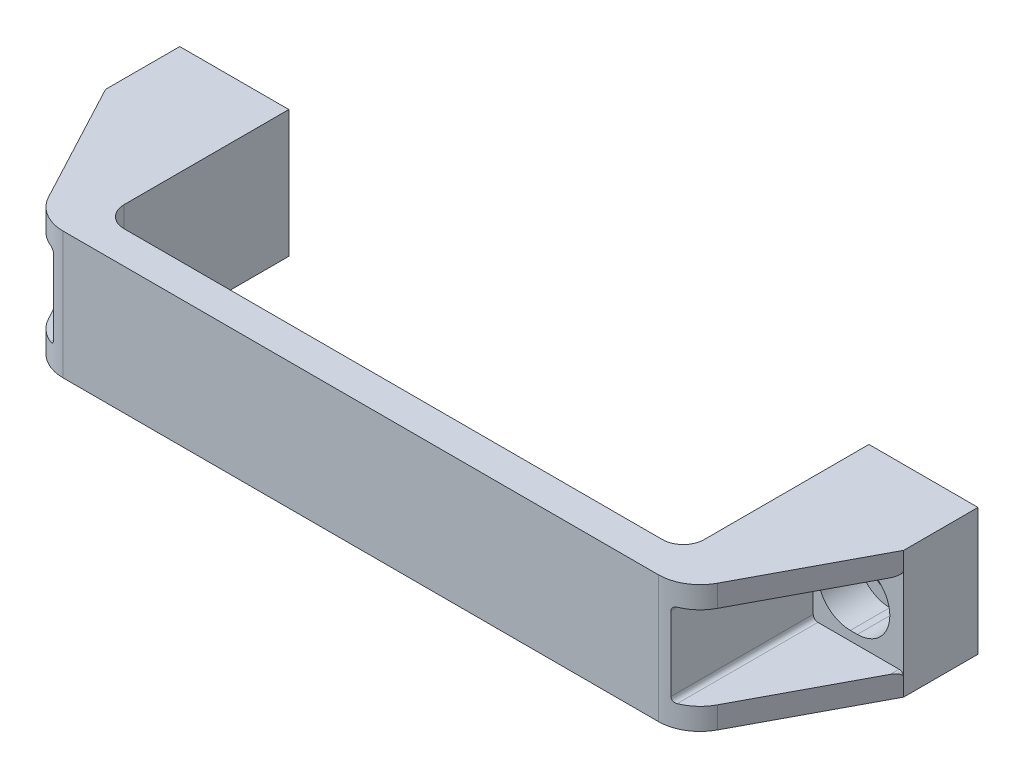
ISO-10303-21;
HEADER;
FILE_DESCRIPTION(('STEP AP214'),'2;1');
FILE_NAME('part.step','',(''),(''),'','','');
FILE_SCHEMA(('AUTOMOTIVE_DESIGN { 1 0 10303 214 1 1 1 1 }'));
ENDSEC;
DATA;
#1=APPLICATION_CONTEXT('core data for automotive mechanical design processes');
#2=APPLICATION_PROTOCOL_DEFINITION('international standard','automotive_design',2000,#1);
#3=PRODUCT_CONTEXT('',#1,'mechanical');
#4=PRODUCT('Part','Part','',(#3));
#5=PRODUCT_RELATED_PRODUCT_CATEGORY('part','',(#4));
#6=PRODUCT_DEFINITION_FORMATION('','',#4);
#7=PRODUCT_DEFINITION_CONTEXT('part definition',#1,'design');
#8=PRODUCT_DEFINITION('design','',#6,#7);
#9=PRODUCT_DEFINITION_SHAPE('','',#8);
#10=(LENGTH_UNIT() NAMED_UNIT(*) SI_UNIT(.MILLI.,.METRE.));
#11=(NAMED_UNIT(*) PLANE_ANGLE_UNIT() SI_UNIT($,.RADIAN.));
#12=(NAMED_UNIT(*) SI_UNIT($,.STERADIAN.) SOLID_ANGLE_UNIT());
#13=UNCERTAINTY_MEASURE_WITH_UNIT(LENGTH_MEASURE(1.E-05),#10,'distance_accuracy_value','');
#14=(GEOMETRIC_REPRESENTATION_CONTEXT(3) GLOBAL_UNCERTAINTY_ASSIGNED_CONTEXT((#13)) GLOBAL_UNIT_ASSIGNED_CONTEXT((#10,
#11,#12)) REPRESENTATION_CONTEXT('',''));
#15=CARTESIAN_POINT('',(0.,0.,0.));
#16=DIRECTION('',(0.,0.,1.));
#17=DIRECTION('',(1.,0.,0.));
#18=AXIS2_PLACEMENT_3D('',#15,#16,#17);
#19=CARTESIAN_POINT('',(0.,7.,16.));
#20=DIRECTION('',(0.,1.,0.));
#21=DIRECTION('',(-1.,0.,0.));
#22=AXIS2_PLACEMENT_3D('',#19,#20,#21);
#23=PLANE('',#22);
#24=DIRECTION('',(0.,0.,1.));
#25=VECTOR('',#24,1.);
#26=CARTESIAN_POINT('',(0.,7.,16.));
#27=LINE('',#26,#25);
#28=CARTESIAN_POINT('',(0.,7.,7.5));
#29=VERTEX_POINT('',#28);
#30=CARTESIAN_POINT('',(0.,7.,16.));
#31=VERTEX_POINT('',#30);
#32=EDGE_CURVE('E298',#29,#31,#27,.T.);
#33=ORIENTED_EDGE('',*,*,#32,.T.);
#34=DIRECTION('',(-1.,0.,0.));
#35=VECTOR('',#34,1.);
#36=CARTESIAN_POINT('',(0.,7.,16.));
#37=LINE('',#36,#35);
#38=CARTESIAN_POINT('',(-1.5,7.,16.));
#39=VERTEX_POINT('',#38);
#40=EDGE_CURVE('E339',#39,#31,#37,.F.);
#41=ORIENTED_EDGE('',*,*,#40,.F.);
#42=DIRECTION('',(0.,0.,1.));
#43=VECTOR('',#42,1.);
#44=CARTESIAN_POINT('',(-1.5,7.,16.));
#45=LINE('',#44,#43);
#46=CARTESIAN_POINT('',(-1.5,7.,7.5));
#47=VERTEX_POINT('',#46);
#48=EDGE_CURVE('E274',#39,#47,#45,.F.);
#49=ORIENTED_EDGE('',*,*,#48,.T.);
#50=DIRECTION('',(1.,0.,0.));
#51=VECTOR('',#50,1.);
#52=CARTESIAN_POINT('',(74.5,7.,7.5));
#53=LINE('',#52,#51);
#54=EDGE_CURVE('E291',#29,#47,#53,.F.);
#55=ORIENTED_EDGE('',*,*,#54,.F.);
#56=EDGE_LOOP('',(#33,#41,#49,#55));
#57=FACE_BOUND('',#56,.T.);
#58=ADVANCED_FACE('F14',(#57),#23,.F.);
#59=CARTESIAN_POINT('',(-1.5,-7.,16.));
#60=DIRECTION('',(0.,-1.,0.));
#61=DIRECTION('',(1.,0.,0.));
#62=AXIS2_PLACEMENT_3D('',#59,#60,#61);
#63=PLANE('',#62);
#64=DIRECTION('',(0.,0.,1.));
#65=VECTOR('',#64,1.);
#66=CARTESIAN_POINT('',(-1.5,-7.,16.));
#67=LINE('',#66,#65);
#68=CARTESIAN_POINT('',(-1.5,-7.,7.5));
#69=VERTEX_POINT('',#68);
#70=CARTESIAN_POINT('',(-1.5,-7.,16.));
#71=VERTEX_POINT('',#70);
#72=EDGE_CURVE('E284',#69,#71,#67,.T.);
#73=ORIENTED_EDGE('',*,*,#72,.T.);
#74=DIRECTION('',(1.,0.,0.));
#75=VECTOR('',#74,1.);
#76=CARTESIAN_POINT('',(-1.5,-7.,16.));
#77=LINE('',#76,#75);
#78=CARTESIAN_POINT('',(0.,-7.,16.));
#79=VERTEX_POINT('',#78);
#80=EDGE_CURVE('E337',#79,#71,#77,.F.);
#81=ORIENTED_EDGE('',*,*,#80,.F.);
#82=DIRECTION('',(0.,0.,1.));
#83=VECTOR('',#82,1.);
#84=CARTESIAN_POINT('',(0.,-7.,16.));
#85=LINE('',#84,#83);
#86=CARTESIAN_POINT('',(0.,-7.,7.5));
#87=VERTEX_POINT('',#86);
#88=EDGE_CURVE('E287',#79,#87,#85,.F.);
#89=ORIENTED_EDGE('',*,*,#88,.T.);
#90=DIRECTION('',(1.,0.,0.));
#91=VECTOR('',#90,1.);
#92=CARTESIAN_POINT('',(74.5,-7.,7.5));
#93=LINE('',#92,#91);
#94=EDGE_CURVE('E280',#69,#87,#93,.T.);
#95=ORIENTED_EDGE('',*,*,#94,.F.);
#96=EDGE_LOOP('',(#73,#81,#89,#95));
#97=FACE_BOUND('',#96,.T.);
#98=ADVANCED_FACE('F282',(#97),#63,.F.);
#99=CARTESIAN_POINT('',(150.5,7.,16.));
#100=DIRECTION('',(0.,1.,0.));
#101=DIRECTION('',(-1.,0.,0.));
#102=AXIS2_PLACEMENT_3D('',#99,#100,#101);
#103=PLANE('',#102);
#104=DIRECTION('',(0.,0.,1.));
#105=VECTOR('',#104,1.);
#106=CARTESIAN_POINT('',(150.5,7.,16.));
#107=LINE('',#106,#105);
#108=CARTESIAN_POINT('',(150.5,7.,7.5));
#109=VERTEX_POINT('',#108);
#110=CARTESIAN_POINT('',(150.5,7.,16.));
#111=VERTEX_POINT('',#110);
#112=EDGE_CURVE('E783',#109,#111,#107,.T.);
#113=ORIENTED_EDGE('',*,*,#112,.T.);
#114=DIRECTION('',(-1.,0.,0.));
#115=VECTOR('',#114,1.);
#116=CARTESIAN_POINT('',(150.5,7.,16.));
#117=LINE('',#116,#115);
#118=CARTESIAN_POINT('',(149.,7.,16.));
#119=VERTEX_POINT('',#118);
#120=EDGE_CURVE('E335',#119,#111,#117,.F.);
#121=ORIENTED_EDGE('',*,*,#120,.F.);
#122=DIRECTION('',(0.,0.,1.));
#123=VECTOR('',#122,1.);
#124=CARTESIAN_POINT('',(149.,7.,16.));
#125=LINE('',#124,#123);
#126=CARTESIAN_POINT('',(149.,7.,7.5));
#127=VERTEX_POINT('',#126);
#128=EDGE_CURVE('E793',#119,#127,#125,.F.);
#129=ORIENTED_EDGE('',*,*,#128,.T.);
#130=DIRECTION('',(1.,0.,0.));
#131=VECTOR('',#130,1.);
#132=CARTESIAN_POINT('',(74.5,7.,7.5));
#133=LINE('',#132,#131);
#134=EDGE_CURVE('E302',#109,#127,#133,.F.);
#135=ORIENTED_EDGE('',*,*,#134,.F.);
#136=EDGE_LOOP('',(#113,#121,#129,#135));
#137=FACE_BOUND('',#136,.T.);
#138=ADVANCED_FACE('F859',(#137),#103,.F.);
#139=CARTESIAN_POINT('',(149.,-7.,16.));
#140=DIRECTION('',(0.,-1.,0.));
#141=DIRECTION('',(1.,0.,0.));
#142=AXIS2_PLACEMENT_3D('',#139,#140,#141);
#143=PLANE('',#142);
#144=DIRECTION('',(0.,0.,1.));
#145=VECTOR('',#144,1.);
#146=CARTESIAN_POINT('',(149.,-7.,16.));
#147=LINE('',#146,#145);
#148=CARTESIAN_POINT('',(149.,-7.,7.5));
#149=VERTEX_POINT('',#148);
#150=CARTESIAN_POINT('',(149.,-7.,16.));
#151=VERTEX_POINT('',#150);
#152=EDGE_CURVE('E790',#149,#151,#147,.T.);
#153=ORIENTED_EDGE('',*,*,#152,.T.);
#154=DIRECTION('',(1.,0.,0.));
#155=VECTOR('',#154,1.);
#156=CARTESIAN_POINT('',(149.,-7.,16.));
#157=LINE('',#156,#155);
#158=CARTESIAN_POINT('',(150.5,-7.,16.));
#159=VERTEX_POINT('',#158);
#160=EDGE_CURVE('E333',#159,#151,#157,.F.);
#161=ORIENTED_EDGE('',*,*,#160,.F.);
#162=DIRECTION('',(0.,0.,1.));
#163=VECTOR('',#162,1.);
#164=CARTESIAN_POINT('',(150.5,-7.,16.));
#165=LINE('',#164,#163);
#166=CARTESIAN_POINT('',(150.5,-7.,7.5));
#167=VERTEX_POINT('',#166);
#168=EDGE_CURVE('E786',#159,#167,#165,.F.);
#169=ORIENTED_EDGE('',*,*,#168,.T.);
#170=DIRECTION('',(1.,0.,0.));
#171=VECTOR('',#170,1.);
#172=CARTESIAN_POINT('',(74.5,-7.,7.5));
#173=LINE('',#172,#171);
#174=EDGE_CURVE('E306',#149,#167,#173,.T.);
#175=ORIENTED_EDGE('',*,*,#174,.F.);
#176=EDGE_LOOP('',(#153,#161,#169,#175));
#177=FACE_BOUND('',#176,.T.);
#178=ADVANCED_FACE('F853',(#177),#143,.F.);
#179=CARTESIAN_POINT('',(0.,4.25,16.));
#180=DIRECTION('',(0.,1.,0.));
#181=DIRECTION('',(-1.,0.,0.));
#182=AXIS2_PLACEMENT_3D('',#179,#180,#181);
#183=PLANE('',#182);
#184=DIRECTION('',(0.,0.,1.));
#185=VECTOR('',#184,1.);
#186=CARTESIAN_POINT('',(-1.5,4.25,16.));
#187=LINE('',#186,#185);
#188=CARTESIAN_POINT('',(-1.5,4.25,7.5));
#189=VERTEX_POINT('',#188);
#190=CARTESIAN_POINT('',(-1.5,4.25,0.));
#191=VERTEX_POINT('',#190);
#192=EDGE_CURVE('E767',#189,#191,#187,.F.);
#193=ORIENTED_EDGE('',*,*,#192,.T.);
#194=DIRECTION('',(-1.,0.,0.));
#195=VECTOR('',#194,1.);
#196=CARTESIAN_POINT('',(0.,4.25,0.));
#197=LINE('',#196,#195);
#198=CARTESIAN_POINT('',(0.,4.25,0.));
#199=VERTEX_POINT('',#198);
#200=EDGE_CURVE('E331',#199,#191,#197,.T.);
#201=ORIENTED_EDGE('',*,*,#200,.F.);
#202=DIRECTION('',(0.,0.,1.));
#203=VECTOR('',#202,1.);
#204=CARTESIAN_POINT('',(0.,4.25,16.));
#205=LINE('',#204,#203);
#206=CARTESIAN_POINT('',(0.,4.25,7.5));
#207=VERTEX_POINT('',#206);
#208=EDGE_CURVE('E774',#199,#207,#205,.T.);
#209=ORIENTED_EDGE('',*,*,#208,.T.);
#210=DIRECTION('',(1.,0.,0.));
#211=VECTOR('',#210,1.);
#212=CARTESIAN_POINT('',(74.5,4.25,7.5));
#213=LINE('',#212,#211);
#214=EDGE_CURVE('E292',#189,#207,#213,.T.);
#215=ORIENTED_EDGE('',*,*,#214,.F.);
#216=EDGE_LOOP('',(#193,#201,#209,#215));
#217=FACE_BOUND('',#216,.T.);
#218=ADVANCED_FACE('F838',(#217),#183,.F.);
#219=CARTESIAN_POINT('',(-1.5,-4.25,16.));
#220=DIRECTION('',(0.,-1.,0.));
#221=DIRECTION('',(1.,0.,0.));
#222=AXIS2_PLACEMENT_3D('',#219,#220,#221);
#223=PLANE('',#222);
#224=DIRECTION('',(0.,0.,1.));
#225=VECTOR('',#224,1.);
#226=CARTESIAN_POINT('',(0.,-4.25,16.));
#227=LINE('',#226,#225);
#228=CARTESIAN_POINT('',(0.,-4.25,7.5));
#229=VERTEX_POINT('',#228);
#230=CARTESIAN_POINT('',(0.,-4.25,0.));
#231=VERTEX_POINT('',#230);
#232=EDGE_CURVE('E518',#229,#231,#227,.F.);
#233=ORIENTED_EDGE('',*,*,#232,.T.);
#234=DIRECTION('',(1.,0.,0.));
#235=VECTOR('',#234,1.);
#236=CARTESIAN_POINT('',(-1.5,-4.25,0.));
#237=LINE('',#236,#235);
#238=CARTESIAN_POINT('',(-1.5,-4.25,0.));
#239=VERTEX_POINT('',#238);
#240=EDGE_CURVE('E329',#239,#231,#237,.T.);
#241=ORIENTED_EDGE('',*,*,#240,.F.);
#242=DIRECTION('',(0.,0.,1.));
#243=VECTOR('',#242,1.);
#244=CARTESIAN_POINT('',(-1.5,-4.25,16.));
#245=LINE('',#244,#243);
#246=CARTESIAN_POINT('',(-1.5,-4.25,7.5));
#247=VERTEX_POINT('',#246);
#248=EDGE_CURVE('E770',#239,#247,#245,.T.);
#249=ORIENTED_EDGE('',*,*,#248,.T.);
#250=DIRECTION('',(1.,0.,0.));
#251=VECTOR('',#250,1.);
#252=CARTESIAN_POINT('',(74.5,-4.25,7.5));
#253=LINE('',#252,#251);
#254=EDGE_CURVE('E326',#229,#247,#253,.F.);
#255=ORIENTED_EDGE('',*,*,#254,.F.);
#256=EDGE_LOOP('',(#233,#241,#249,#255));
#257=FACE_BOUND('',#256,.T.);
#258=ADVANCED_FACE('F844',(#257),#223,.F.);
#259=CARTESIAN_POINT('',(74.5,0.,7.5));
#260=DIRECTION('',(0.,0.,1.));
#261=DIRECTION('',(0.,-1.,0.));
#262=AXIS2_PLACEMENT_3D('',#259,#260,#261);
#263=PLANE('',#262);
#264=ORIENTED_EDGE('',*,*,#54,.T.);
#265=CARTESIAN_POINT('',(-1.5,0.,7.5));
#266=DIRECTION('',(0.,0.,1.));
#267=DIRECTION('',(0.,-1.,0.));
#268=AXIS2_PLACEMENT_3D('',#265,#266,#267);
#269=CIRCLE('',#268,7.);
#270=EDGE_CURVE('E17',#47,#69,#269,.T.);
#271=ORIENTED_EDGE('',*,*,#270,.T.);
#272=ORIENTED_EDGE('',*,*,#94,.T.);
#273=CARTESIAN_POINT('',(0.,0.,7.5));
#274=DIRECTION('',(0.,0.,1.));
#275=DIRECTION('',(0.,-1.,0.));
#276=AXIS2_PLACEMENT_3D('',#273,#274,#275);
#277=CIRCLE('',#276,7.);
#278=EDGE_CURVE('E794',#87,#29,#277,.T.);
#279=ORIENTED_EDGE('',*,*,#278,.T.);
#280=EDGE_LOOP('',(#264,#271,#272,#279));
#281=FACE_BOUND('',#280,.T.);
#282=ORIENTED_EDGE('',*,*,#214,.T.);
#283=CARTESIAN_POINT('',(0.,0.,7.5));
#284=DIRECTION('',(0.,0.,1.));
#285=DIRECTION('',(0.,-1.,0.));
#286=AXIS2_PLACEMENT_3D('',#283,#284,#285);
#287=CIRCLE('',#286,4.25);
#288=EDGE_CURVE('E520',#207,#229,#287,.F.);
#289=ORIENTED_EDGE('',*,*,#288,.T.);
#290=ORIENTED_EDGE('',*,*,#254,.T.);
#291=CARTESIAN_POINT('',(-1.5,0.,7.5));
#292=DIRECTION('',(0.,0.,1.));
#293=DIRECTION('',(0.,-1.,0.));
#294=AXIS2_PLACEMENT_3D('',#291,#292,#293);
#295=CIRCLE('',#294,4.25);
#296=EDGE_CURVE('E765',#247,#189,#295,.F.);
#297=ORIENTED_EDGE('',*,*,#296,.T.);
#298=EDGE_LOOP('',(#282,#289,#290,#297));
#299=FACE_BOUND('',#298,.T.);
#300=ADVANCED_FACE('F295',(#281,#299),#263,.T.);
#301=CARTESIAN_POINT('',(150.5,4.25,16.));
#302=DIRECTION('',(0.,1.,0.));
#303=DIRECTION('',(-1.,0.,0.));
#304=AXIS2_PLACEMENT_3D('',#301,#302,#303);
#305=PLANE('',#304);
#306=DIRECTION('',(0.,0.,1.));
#307=VECTOR('',#306,1.);
#308=CARTESIAN_POINT('',(149.,4.25,16.));
#309=LINE('',#308,#307);
#310=CARTESIAN_POINT('',(149.,4.25,7.5));
#311=VERTEX_POINT('',#310);
#312=CARTESIAN_POINT('',(149.,4.25,0.));
#313=VERTEX_POINT('',#312);
#314=EDGE_CURVE('E754',#311,#313,#309,.F.);
#315=ORIENTED_EDGE('',*,*,#314,.T.);
#316=DIRECTION('',(-1.,0.,0.));
#317=VECTOR('',#316,1.);
#318=CARTESIAN_POINT('',(150.5,4.25,0.));
#319=LINE('',#318,#317);
#320=CARTESIAN_POINT('',(150.5,4.25,0.));
#321=VERTEX_POINT('',#320);
#322=EDGE_CURVE('E321',#321,#313,#319,.T.);
#323=ORIENTED_EDGE('',*,*,#322,.F.);
#324=DIRECTION('',(0.,0.,1.));
#325=VECTOR('',#324,1.);
#326=CARTESIAN_POINT('',(150.5,4.25,16.));
#327=LINE('',#326,#325);
#328=CARTESIAN_POINT('',(150.5,4.25,7.5));
#329=VERTEX_POINT('',#328);
#330=EDGE_CURVE('E764',#321,#329,#327,.T.);
#331=ORIENTED_EDGE('',*,*,#330,.T.);
#332=DIRECTION('',(1.,0.,0.));
#333=VECTOR('',#332,1.);
#334=CARTESIAN_POINT('',(74.5,4.25,7.5));
#335=LINE('',#334,#333);
#336=EDGE_CURVE('E313',#311,#329,#335,.T.);
#337=ORIENTED_EDGE('',*,*,#336,.F.);
#338=EDGE_LOOP('',(#315,#323,#331,#337));
#339=FACE_BOUND('',#338,.T.);
#340=ADVANCED_FACE('F851',(#339),#305,.F.);
#341=CARTESIAN_POINT('',(149.,-4.25,16.));
#342=DIRECTION('',(0.,-1.,0.));
#343=DIRECTION('',(1.,0.,0.));
#344=AXIS2_PLACEMENT_3D('',#341,#342,#343);
#345=PLANE('',#344);
#346=DIRECTION('',(0.,0.,1.));
#347=VECTOR('',#346,1.);
#348=CARTESIAN_POINT('',(150.5,-4.25,16.));
#349=LINE('',#348,#347);
#350=CARTESIAN_POINT('',(150.5,-4.25,7.5));
#351=VERTEX_POINT('',#350);
#352=CARTESIAN_POINT('',(150.5,-4.25,0.));
#353=VERTEX_POINT('',#352);
#354=EDGE_CURVE('E761',#351,#353,#349,.F.);
#355=ORIENTED_EDGE('',*,*,#354,.T.);
#356=DIRECTION('',(1.,0.,0.));
#357=VECTOR('',#356,1.);
#358=CARTESIAN_POINT('',(149.,-4.25,0.));
#359=LINE('',#358,#357);
#360=CARTESIAN_POINT('',(149.,-4.25,0.));
#361=VERTEX_POINT('',#360);
#362=EDGE_CURVE('E319',#361,#353,#359,.T.);
#363=ORIENTED_EDGE('',*,*,#362,.F.);
#364=DIRECTION('',(0.,0.,1.));
#365=VECTOR('',#364,1.);
#366=CARTESIAN_POINT('',(149.,-4.25,16.));
#367=LINE('',#366,#365);
#368=CARTESIAN_POINT('',(149.,-4.25,7.5));
#369=VERTEX_POINT('',#368);
#370=EDGE_CURVE('E757',#361,#369,#367,.T.);
#371=ORIENTED_EDGE('',*,*,#370,.T.);
#372=DIRECTION('',(1.,0.,0.));
#373=VECTOR('',#372,1.);
#374=CARTESIAN_POINT('',(74.5,-4.25,7.5));
#375=LINE('',#374,#373);
#376=EDGE_CURVE('E316',#351,#369,#375,.F.);
#377=ORIENTED_EDGE('',*,*,#376,.F.);
#378=EDGE_LOOP('',(#355,#363,#371,#377));
#379=FACE_BOUND('',#378,.T.);
#380=ADVANCED_FACE('F917',(#379),#345,.F.);
#381=CARTESIAN_POINT('',(74.5,0.,7.5));
#382=DIRECTION('',(0.,0.,1.));
#383=DIRECTION('',(0.,-1.,0.));
#384=AXIS2_PLACEMENT_3D('',#381,#382,#383);
#385=PLANE('',#384);
#386=ORIENTED_EDGE('',*,*,#134,.T.);
#387=CARTESIAN_POINT('',(149.,0.,7.5));
#388=DIRECTION('',(0.,0.,1.));
#389=DIRECTION('',(0.,-1.,0.));
#390=AXIS2_PLACEMENT_3D('',#387,#388,#389);
#391=CIRCLE('',#390,7.);
#392=EDGE_CURVE('E787',#127,#149,#391,.T.);
#393=ORIENTED_EDGE('',*,*,#392,.T.);
#394=ORIENTED_EDGE('',*,*,#174,.T.);
#395=CARTESIAN_POINT('',(150.5,0.,7.5));
#396=DIRECTION('',(0.,0.,1.));
#397=DIRECTION('',(0.,-1.,0.));
#398=AXIS2_PLACEMENT_3D('',#395,#396,#397);
#399=CIRCLE('',#398,7.);
#400=EDGE_CURVE('E789',#167,#109,#399,.T.);
#401=ORIENTED_EDGE('',*,*,#400,.T.);
#402=EDGE_LOOP('',(#386,#393,#394,#401));
#403=FACE_BOUND('',#402,.T.);
#404=ORIENTED_EDGE('',*,*,#336,.T.);
#405=CARTESIAN_POINT('',(150.5,0.,7.5));
#406=DIRECTION('',(0.,0.,1.));
#407=DIRECTION('',(0.,-1.,0.));
#408=AXIS2_PLACEMENT_3D('',#405,#406,#407);
#409=CIRCLE('',#408,4.25);
#410=EDGE_CURVE('E758',#329,#351,#409,.F.);
#411=ORIENTED_EDGE('',*,*,#410,.T.);
#412=ORIENTED_EDGE('',*,*,#376,.T.);
#413=CARTESIAN_POINT('',(149.,0.,7.5));
#414=DIRECTION('',(0.,0.,1.));
#415=DIRECTION('',(0.,-1.,0.));
#416=AXIS2_PLACEMENT_3D('',#413,#414,#415);
#417=CIRCLE('',#416,4.25);
#418=EDGE_CURVE('E760',#369,#311,#417,.F.);
#419=ORIENTED_EDGE('',*,*,#418,.T.);
#420=EDGE_LOOP('',(#404,#411,#412,#419));
#421=FACE_BOUND('',#420,.T.);
#422=ADVANCED_FACE('F926',(#403,#421),#385,.T.);
#423=CARTESIAN_POINT('',(-1.5,0.,16.));
#424=DIRECTION('',(0.,0.,1.));
#425=DIRECTION('',(0.,-1.,0.));
#426=AXIS2_PLACEMENT_3D('',#423,#424,#425);
#427=CYLINDRICAL_SURFACE('',#426,7.);
#428=ORIENTED_EDGE('',*,*,#48,.F.);
#429=CARTESIAN_POINT('',(-1.5,0.,16.));
#430=DIRECTION('',(0.,0.,1.));
#431=DIRECTION('',(0.,-1.,0.));
#432=AXIS2_PLACEMENT_3D('',#429,#430,#431);
#433=CIRCLE('',#432,7.);
#434=EDGE_CURVE('E301',#71,#39,#433,.F.);
#435=ORIENTED_EDGE('',*,*,#434,.F.);
#436=ORIENTED_EDGE('',*,*,#72,.F.);
#437=ORIENTED_EDGE('',*,*,#270,.F.);
#438=EDGE_LOOP('',(#428,#435,#436,#437));
#439=FACE_BOUND('',#438,.T.);
#440=ADVANCED_FACE('F299',(#439),#427,.F.);
#441=CARTESIAN_POINT('',(0.,0.,16.));
#442=DIRECTION('',(0.,0.,1.));
#443=DIRECTION('',(0.,-1.,0.));
#444=AXIS2_PLACEMENT_3D('',#441,#442,#443);
#445=CYLINDRICAL_SURFACE('',#444,7.);
#446=ORIENTED_EDGE('',*,*,#88,.F.);
#447=CARTESIAN_POINT('',(0.,0.,16.));
#448=DIRECTION('',(0.,0.,1.));
#449=DIRECTION('',(0.,-1.,0.));
#450=AXIS2_PLACEMENT_3D('',#447,#448,#449);
#451=CIRCLE('',#450,7.);
#452=EDGE_CURVE('E821',#31,#79,#451,.F.);
#453=ORIENTED_EDGE('',*,*,#452,.F.);
#454=ORIENTED_EDGE('',*,*,#32,.F.);
#455=ORIENTED_EDGE('',*,*,#278,.F.);
#456=EDGE_LOOP('',(#446,#453,#454,#455));
#457=FACE_BOUND('',#456,.T.);
#458=ADVANCED_FACE('F944',(#457),#445,.F.);
#459=CARTESIAN_POINT('',(149.,0.,16.));
#460=DIRECTION('',(0.,0.,1.));
#461=DIRECTION('',(0.,-1.,0.));
#462=AXIS2_PLACEMENT_3D('',#459,#460,#461);
#463=CYLINDRICAL_SURFACE('',#462,7.);
#464=ORIENTED_EDGE('',*,*,#128,.F.);
#465=CARTESIAN_POINT('',(149.,0.,16.));
#466=DIRECTION('',(0.,0.,1.));
#467=DIRECTION('',(0.,-1.,0.));
#468=AXIS2_PLACEMENT_3D('',#465,#466,#467);
#469=CIRCLE('',#468,7.);
#470=EDGE_CURVE('E456',#151,#119,#469,.F.);
#471=ORIENTED_EDGE('',*,*,#470,.F.);
#472=ORIENTED_EDGE('',*,*,#152,.F.);
#473=ORIENTED_EDGE('',*,*,#392,.F.);
#474=EDGE_LOOP('',(#464,#471,#472,#473));
#475=FACE_BOUND('',#474,.T.);
#476=ADVANCED_FACE('F953',(#475),#463,.F.);
#477=CARTESIAN_POINT('',(150.5,0.,16.));
#478=DIRECTION('',(0.,0.,1.));
#479=DIRECTION('',(0.,-1.,0.));
#480=AXIS2_PLACEMENT_3D('',#477,#478,#479);
#481=CYLINDRICAL_SURFACE('',#480,7.);
#482=ORIENTED_EDGE('',*,*,#168,.F.);
#483=CARTESIAN_POINT('',(150.5,0.,16.));
#484=DIRECTION('',(0.,0.,1.));
#485=DIRECTION('',(0.,-1.,0.));
#486=AXIS2_PLACEMENT_3D('',#483,#484,#485);
#487=CIRCLE('',#486,7.);
#488=EDGE_CURVE('E1268',#111,#159,#487,.F.);
#489=ORIENTED_EDGE('',*,*,#488,.F.);
#490=ORIENTED_EDGE('',*,*,#112,.F.);
#491=ORIENTED_EDGE('',*,*,#400,.F.);
#492=EDGE_LOOP('',(#482,#489,#490,#491));
#493=FACE_BOUND('',#492,.T.);
#494=ADVANCED_FACE('F963',(#493),#481,.F.);
#495=CARTESIAN_POINT('',(7.,8.,47.));
#496=DIRECTION('',(0.,0.,1.));
#497=DIRECTION('',(0.,-1.,0.));
#498=AXIS2_PLACEMENT_3D('',#495,#496,#497);
#499=CYLINDRICAL_SURFACE('',#498,0.999999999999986);
#500=DIRECTION('',(0.,0.,1.));
#501=VECTOR('',#500,1.);
#502=CARTESIAN_POINT('',(7.,9.,47.));
#503=LINE('',#502,#501);
#504=CARTESIAN_POINT('',(7.,9.,46.3368396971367));
#505=VERTEX_POINT('',#504);
#506=CARTESIAN_POINT('',(7.,9.,16.));
#507=VERTEX_POINT('',#506);
#508=EDGE_CURVE('E430',#505,#507,#503,.F.);
#509=ORIENTED_EDGE('',*,*,#508,.T.);
#510=CARTESIAN_POINT('',(7.,8.,16.));
#511=DIRECTION('',(0.,0.,1.));
#512=DIRECTION('',(0.,-1.,0.));
#513=AXIS2_PLACEMENT_3D('',#510,#511,#512);
#514=CIRCLE('',#513,0.999999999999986);
#515=CARTESIAN_POINT('',(8.,8.,16.));
#516=VERTEX_POINT('',#515);
#517=EDGE_CURVE('E809',#516,#507,#514,.T.);
#518=ORIENTED_EDGE('',*,*,#517,.F.);
#519=DIRECTION('',(0.,0.,1.));
#520=VECTOR('',#519,1.);
#521=CARTESIAN_POINT('',(8.,8.,47.));
#522=LINE('',#521,#520);
#523=CARTESIAN_POINT('',(8.,8.,46.6766567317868));
#524=VERTEX_POINT('',#523);
#525=EDGE_CURVE('E720',#516,#524,#522,.T.);
#526=ORIENTED_EDGE('',*,*,#525,.T.);
#527=CARTESIAN_POINT('',(7.,9.,46.3368396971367));
#528=CARTESIAN_POINT('',(7.05760866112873,9.00004318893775,46.3602976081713));
#529=CARTESIAN_POINT('',(7.11552196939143,8.99502148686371,46.3831291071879));
#530=CARTESIAN_POINT('',(7.23035255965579,8.97484417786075,46.4270771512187));
#531=CARTESIAN_POINT('',(7.28726760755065,8.95966823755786,46.4481901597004));
#532=CARTESIAN_POINT('',(7.39836694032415,8.919135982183,46.4881824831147));
#533=CARTESIAN_POINT('',(7.45254527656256,8.89375848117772,46.5070570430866));
#534=CARTESIAN_POINT('',(7.55607466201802,8.83328692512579,46.5421110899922));
#535=CARTESIAN_POINT('',(7.60543149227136,8.79820470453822,46.558293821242));
#536=CARTESIAN_POINT('',(7.69515652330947,8.72116358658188,46.586964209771));
#537=CARTESIAN_POINT('',(7.73585242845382,8.67964052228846,46.5995970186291));
#538=CARTESIAN_POINT('',(7.80972913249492,8.5896812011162,46.6220582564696));
#539=CARTESIAN_POINT('',(7.84290861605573,8.54124373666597,46.6318861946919));
#540=CARTESIAN_POINT('',(7.89898997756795,8.44150625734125,46.6482371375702));
#541=CARTESIAN_POINT('',(7.92232347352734,8.39047122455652,46.6549010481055));
#542=CARTESIAN_POINT('',(7.96015942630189,8.2849976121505,46.6656032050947));
#543=CARTESIAN_POINT('',(7.97467220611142,8.23056309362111,46.6696445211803));
#544=CARTESIAN_POINT('',(7.98966824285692,8.14636727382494,46.6738048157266));
#545=CARTESIAN_POINT('',(7.99354145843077,8.11721568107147,46.6748752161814));
#546=CARTESIAN_POINT('',(7.99870568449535,8.05871420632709,46.6763001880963));
#547=CARTESIAN_POINT('',(8.00000080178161,8.02936471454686,46.6766558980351));
#548=CARTESIAN_POINT('',(8.,8.,46.6766567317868));
#549=B_SPLINE_CURVE_WITH_KNOTS('',3,(#527,#528,#529,#530,#531,#532,#533,#534,#535,#536,#537,
#538,#539,#540,#541,#542,#543,#544,#545,#546,#547,#548),.UNSPECIFIED.,.F.,.F.,(4,2,2,2,2,2,2,2,
2,2,4),(0.,0.186469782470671,0.373314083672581,0.560548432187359,0.747555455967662,
0.925134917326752,1.10274543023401,1.27145789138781,1.43997252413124,1.52814649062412,
1.61617988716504),.UNSPECIFIED.);
#550=EDGE_CURVE('E519',#505,#524,#549,.T.);
#551=ORIENTED_EDGE('',*,*,#550,.F.);
#552=EDGE_LOOP('',(#509,#518,#526,#551));
#553=FACE_BOUND('',#552,.T.);
#554=ADVANCED_FACE('F506',(#553),#499,.F.);
#555=CARTESIAN_POINT('',(7.,-8.,47.));
#556=DIRECTION('',(0.,0.,1.));
#557=DIRECTION('',(0.,-1.,0.));
#558=AXIS2_PLACEMENT_3D('',#555,#556,#557);
#559=CYLINDRICAL_SURFACE('',#558,0.999999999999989);
#560=DIRECTION('',(0.,0.,1.));
#561=VECTOR('',#560,1.);
#562=CARTESIAN_POINT('',(8.,-8.,47.));
#563=LINE('',#562,#561);
#564=CARTESIAN_POINT('',(8.,-8.,46.6766567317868));
#565=VERTEX_POINT('',#564);
#566=CARTESIAN_POINT('',(8.,-8.,16.));
#567=VERTEX_POINT('',#566);
#568=EDGE_CURVE('E725',#565,#567,#563,.F.);
#569=ORIENTED_EDGE('',*,*,#568,.T.);
#570=CARTESIAN_POINT('',(7.,-8.,16.));
#571=DIRECTION('',(0.,0.,1.));
#572=DIRECTION('',(0.,-1.,0.));
#573=AXIS2_PLACEMENT_3D('',#570,#571,#572);
#574=CIRCLE('',#573,0.999999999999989);
#575=CARTESIAN_POINT('',(7.,-9.,16.));
#576=VERTEX_POINT('',#575);
#577=EDGE_CURVE('E813',#576,#567,#574,.T.);
#578=ORIENTED_EDGE('',*,*,#577,.F.);
#579=DIRECTION('',(0.,0.,1.));
#580=VECTOR('',#579,1.);
#581=CARTESIAN_POINT('',(7.,-9.,47.));
#582=LINE('',#581,#580);
#583=CARTESIAN_POINT('',(7.,-9.,46.3368396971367));
#584=VERTEX_POINT('',#583);
#585=EDGE_CURVE('E714',#576,#584,#582,.T.);
#586=ORIENTED_EDGE('',*,*,#585,.T.);
#587=CARTESIAN_POINT('',(8.,-8.,46.6766567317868));
#588=CARTESIAN_POINT('',(8.00000030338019,-8.02730720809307,46.6766560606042));
#589=CARTESIAN_POINT('',(7.99888071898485,-8.05460117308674,46.6763484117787));
#590=CARTESIAN_POINT('',(7.99441752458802,-8.10899012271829,46.6751170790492));
#591=CARTESIAN_POINT('',(7.991074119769,-8.13608512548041,46.6741934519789));
#592=CARTESIAN_POINT('',(7.97775260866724,-8.21669274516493,46.6705012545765));
#593=CARTESIAN_POINT('',(7.96448303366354,-8.26965927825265,46.6668113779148));
#594=CARTESIAN_POINT('',(7.92961592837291,-8.3725160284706,46.656974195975));
#595=CARTESIAN_POINT('',(7.90801616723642,-8.42240541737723,46.6508262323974));
#596=CARTESIAN_POINT('',(7.85722590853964,-8.5177650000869,46.6360878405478));
#597=CARTESIAN_POINT('',(7.82803531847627,-8.56323514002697,46.627497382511));
#598=CARTESIAN_POINT('',(7.76268574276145,-8.6490382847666,46.607817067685));
#599=CARTESIAN_POINT('',(7.72645484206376,-8.68931044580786,46.5967011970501));
#600=CARTESIAN_POINT('',(7.64841915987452,-8.76317758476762,46.572126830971));
#601=CARTESIAN_POINT('',(7.60661378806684,-8.79677185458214,46.5586680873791));
#602=CARTESIAN_POINT('',(7.51725776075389,-8.85759083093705,46.5290911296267));
#603=CARTESIAN_POINT('',(7.46956220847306,-8.88456636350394,46.5128993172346));
#604=CARTESIAN_POINT('',(7.37102639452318,-8.93020932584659,46.4784472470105));
#605=CARTESIAN_POINT('',(7.32018471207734,-8.94887297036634,46.4601860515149));
#606=CARTESIAN_POINT('',(7.22441404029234,-8.97556830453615,46.4247608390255));
#607=CARTESIAN_POINT('',(7.17971554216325,-8.9847601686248,46.4078306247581));
#608=CARTESIAN_POINT('',(7.08995694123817,-8.99697562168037,46.3730041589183));
#609=CARTESIAN_POINT('',(7.04489774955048,-9.00001161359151,46.3551099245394));
#610=CARTESIAN_POINT('',(7.,-9.,46.3368396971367));
#611=B_SPLINE_CURVE_WITH_KNOTS('',3,(#587,#588,#589,#590,#591,#592,#593,#594,#595,#596,#597,
#598,#599,#600,#601,#602,#603,#604,#605,#606,#607,#608,#609,#610),.UNSPECIFIED.,.F.,.F.,(4,2,2,
2,2,2,2,2,2,2,2,4),(0.,0.0818707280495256,0.163733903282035,0.327071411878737,0.490452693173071,
0.653835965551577,0.818985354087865,0.984152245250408,1.15481564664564,1.3255566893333,
1.47117955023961,1.61650871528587),.UNSPECIFIED.);
#612=EDGE_CURVE('E511',#565,#584,#611,.T.);
#613=ORIENTED_EDGE('',*,*,#612,.F.);
#614=EDGE_LOOP('',(#569,#578,#586,#613));
#615=FACE_BOUND('',#614,.T.);
#616=ADVANCED_FACE('F501',(#615),#559,.F.);
#617=CARTESIAN_POINT('',(-10.5,10.,47.));
#618=DIRECTION('',(0.,0.,1.));
#619=DIRECTION('',(0.,-1.,0.));
#620=AXIS2_PLACEMENT_3D('',#617,#618,#619);
#621=CYLINDRICAL_SURFACE('',#620,0.999999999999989);
#622=CARTESIAN_POINT('',(-10.5,10.,16.));
#623=DIRECTION('',(0.,0.,1.));
#624=DIRECTION('',(0.,-1.,0.));
#625=AXIS2_PLACEMENT_3D('',#622,#623,#624);
#626=CIRCLE('',#625,0.999999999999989);
#627=CARTESIAN_POINT('',(-10.5,9.,16.));
#628=VERTEX_POINT('',#627);
#629=CARTESIAN_POINT('',(-11.5,10.,16.));
#630=VERTEX_POINT('',#629);
#631=EDGE_CURVE('E457',#628,#630,#626,.F.);
#632=ORIENTED_EDGE('',*,*,#631,.F.);
#633=DIRECTION('',(0.,0.,1.));
#634=VECTOR('',#633,1.);
#635=CARTESIAN_POINT('',(-10.5,9.,47.));
#636=LINE('',#635,#634);
#637=CARTESIAN_POINT('',(-10.5,9.,17.8807264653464));
#638=VERTEX_POINT('',#637);
#639=EDGE_CURVE('E727',#628,#638,#636,.T.);
#640=ORIENTED_EDGE('',*,*,#639,.T.);
#641=CARTESIAN_POINT('',(-10.5,10.,17.8807264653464));
#642=DIRECTION('',(-0.882947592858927,0.,0.469471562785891));
#643=DIRECTION('',(0.469471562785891,0.,0.882947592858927));
#644=AXIS2_PLACEMENT_3D('',#641,#642,#643);
#645=ELLIPSE('',#644,2.13005446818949,0.999999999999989);
#646=EDGE_CURVE('E418',#630,#638,#645,.T.);
#647=ORIENTED_EDGE('',*,*,#646,.F.);
#648=EDGE_LOOP('',(#632,#640,#647));
#649=FACE_BOUND('',#648,.T.);
#650=ADVANCED_FACE('F497',(#649),#621,.T.);
#651=CARTESIAN_POINT('',(0.,0.,16.));
#652=DIRECTION('',(0.,0.,1.));
#653=DIRECTION('',(0.,-1.,0.));
#654=AXIS2_PLACEMENT_3D('',#651,#652,#653);
#655=CYLINDRICAL_SURFACE('',#654,4.25);
#656=ORIENTED_EDGE('',*,*,#208,.F.);
#657=CARTESIAN_POINT('',(0.,0.,0.));
#658=DIRECTION('',(0.,0.,1.));
#659=DIRECTION('',(0.,-1.,0.));
#660=AXIS2_PLACEMENT_3D('',#657,#658,#659);
#661=CIRCLE('',#660,4.25);
#662=EDGE_CURVE('E415',#231,#199,#661,.T.);
#663=ORIENTED_EDGE('',*,*,#662,.F.);
#664=ORIENTED_EDGE('',*,*,#232,.F.);
#665=ORIENTED_EDGE('',*,*,#288,.F.);
#666=EDGE_LOOP('',(#656,#663,#664,#665));
#667=FACE_BOUND('',#666,.T.);
#668=ADVANCED_FACE('F493',(#667),#655,.F.);
#669=CARTESIAN_POINT('',(-1.5,0.,16.));
#670=DIRECTION('',(0.,0.,1.));
#671=DIRECTION('',(0.,-1.,0.));
#672=AXIS2_PLACEMENT_3D('',#669,#670,#671);
#673=CYLINDRICAL_SURFACE('',#672,4.25);
#674=ORIENTED_EDGE('',*,*,#248,.F.);
#675=CARTESIAN_POINT('',(-1.5,0.,0.));
#676=DIRECTION('',(0.,0.,1.));
#677=DIRECTION('',(0.,-1.,0.));
#678=AXIS2_PLACEMENT_3D('',#675,#676,#677);
#679=CIRCLE('',#678,4.25);
#680=EDGE_CURVE('E411',#191,#239,#679,.T.);
#681=ORIENTED_EDGE('',*,*,#680,.F.);
#682=ORIENTED_EDGE('',*,*,#192,.F.);
#683=ORIENTED_EDGE('',*,*,#296,.F.);
#684=EDGE_LOOP('',(#674,#681,#682,#683));
#685=FACE_BOUND('',#684,.T.);
#686=ADVANCED_FACE('F489',(#685),#673,.F.);
#687=CARTESIAN_POINT('',(150.5,0.,16.));
#688=DIRECTION('',(0.,0.,1.));
#689=DIRECTION('',(0.,-1.,0.));
#690=AXIS2_PLACEMENT_3D('',#687,#688,#689);
#691=CYLINDRICAL_SURFACE('',#690,4.25);
#692=ORIENTED_EDGE('',*,*,#330,.F.);
#693=CARTESIAN_POINT('',(150.5,0.,0.));
#694=DIRECTION('',(0.,0.,1.));
#695=DIRECTION('',(0.,-1.,0.));
#696=AXIS2_PLACEMENT_3D('',#693,#694,#695);
#697=CIRCLE('',#696,4.25);
#698=EDGE_CURVE('E407',#353,#321,#697,.T.);
#699=ORIENTED_EDGE('',*,*,#698,.F.);
#700=ORIENTED_EDGE('',*,*,#354,.F.);
#701=ORIENTED_EDGE('',*,*,#410,.F.);
#702=EDGE_LOOP('',(#692,#699,#700,#701));
#703=FACE_BOUND('',#702,.T.);
#704=ADVANCED_FACE('F485',(#703),#691,.F.);
#705=CARTESIAN_POINT('',(149.,0.,16.));
#706=DIRECTION('',(0.,0.,1.));
#707=DIRECTION('',(0.,-1.,0.));
#708=AXIS2_PLACEMENT_3D('',#705,#706,#707);
#709=CYLINDRICAL_SURFACE('',#708,4.25);
#710=ORIENTED_EDGE('',*,*,#370,.F.);
#711=CARTESIAN_POINT('',(149.,0.,0.));
#712=DIRECTION('',(0.,0.,1.));
#713=DIRECTION('',(0.,-1.,0.));
#714=AXIS2_PLACEMENT_3D('',#711,#712,#713);
#715=CIRCLE('',#714,4.25);
#716=EDGE_CURVE('E403',#313,#361,#715,.T.);
#717=ORIENTED_EDGE('',*,*,#716,.F.);
#718=ORIENTED_EDGE('',*,*,#314,.F.);
#719=ORIENTED_EDGE('',*,*,#418,.F.);
#720=EDGE_LOOP('',(#710,#717,#718,#719));
#721=FACE_BOUND('',#720,.T.);
#722=ADVANCED_FACE('F481',(#721),#709,.F.);
#723=CARTESIAN_POINT('',(-10.5,-10.,47.));
#724=DIRECTION('',(0.,0.,1.));
#725=DIRECTION('',(0.,-1.,0.));
#726=AXIS2_PLACEMENT_3D('',#723,#724,#725);
#727=CYLINDRICAL_SURFACE('',#726,0.999999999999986);
#728=DIRECTION('',(0.,0.,1.));
#729=VECTOR('',#728,1.);
#730=CARTESIAN_POINT('',(-10.5,-9.,47.));
#731=LINE('',#730,#729);
#732=CARTESIAN_POINT('',(-10.5,-9.,17.8807264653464));
#733=VERTEX_POINT('',#732);
#734=CARTESIAN_POINT('',(-10.5,-9.,16.));
#735=VERTEX_POINT('',#734);
#736=EDGE_CURVE('E723',#733,#735,#731,.F.);
#737=ORIENTED_EDGE('',*,*,#736,.T.);
#738=CARTESIAN_POINT('',(-10.5,-10.,16.));
#739=DIRECTION('',(0.,0.,1.));
#740=DIRECTION('',(0.,-1.,0.));
#741=AXIS2_PLACEMENT_3D('',#738,#739,#740);
#742=CIRCLE('',#741,0.999999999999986);
#743=CARTESIAN_POINT('',(-11.5,-10.,16.));
#744=VERTEX_POINT('',#743);
#745=EDGE_CURVE('E819',#744,#735,#742,.F.);
#746=ORIENTED_EDGE('',*,*,#745,.F.);
#747=CARTESIAN_POINT('',(-10.5,-10.,17.8807264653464));
#748=DIRECTION('',(-0.882947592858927,0.,0.469471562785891));
#749=DIRECTION('',(0.469471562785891,0.,0.882947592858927));
#750=AXIS2_PLACEMENT_3D('',#747,#748,#749);
#751=ELLIPSE('',#750,2.13005446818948,0.999999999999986);
#752=EDGE_CURVE('E398',#733,#744,#751,.T.);
#753=ORIENTED_EDGE('',*,*,#752,.F.);
#754=EDGE_LOOP('',(#737,#746,#753));
#755=FACE_BOUND('',#754,.T.);
#756=ADVANCED_FACE('F477',(#755),#727,.T.);
#757=CARTESIAN_POINT('',(74.5,0.,16.));
#758=DIRECTION('',(0.,0.,1.));
#759=DIRECTION('',(0.,-1.,0.));
#760=AXIS2_PLACEMENT_3D('',#757,#758,#759);
#761=PLANE('',#760);
#762=ORIENTED_EDGE('',*,*,#631,.T.);
#763=DIRECTION('',(0.,-1.,0.));
#764=VECTOR('',#763,1.);
#765=CARTESIAN_POINT('',(-11.5,-13.7,16.));
#766=LINE('',#765,#764);
#767=EDGE_CURVE('E683',#744,#630,#766,.F.);
#768=ORIENTED_EDGE('',*,*,#767,.F.);
#769=ORIENTED_EDGE('',*,*,#745,.T.);
#770=DIRECTION('',(1.,0.,0.));
#771=VECTOR('',#770,1.);
#772=CARTESIAN_POINT('',(-10.5,-9.,16.));
#773=LINE('',#772,#771);
#774=EDGE_CURVE('E719',#735,#576,#773,.T.);
#775=ORIENTED_EDGE('',*,*,#774,.T.);
#776=ORIENTED_EDGE('',*,*,#577,.T.);
#777=DIRECTION('',(0.,1.,0.));
#778=VECTOR('',#777,1.);
#779=CARTESIAN_POINT('',(8.,-8.,16.));
#780=LINE('',#779,#778);
#781=EDGE_CURVE('E724',#567,#516,#780,.T.);
#782=ORIENTED_EDGE('',*,*,#781,.T.);
#783=ORIENTED_EDGE('',*,*,#517,.T.);
#784=DIRECTION('',(-1.,0.,0.));
#785=VECTOR('',#784,1.);
#786=CARTESIAN_POINT('',(7.,9.,16.));
#787=LINE('',#786,#785);
#788=EDGE_CURVE('E729',#507,#628,#787,.T.);
#789=ORIENTED_EDGE('',*,*,#788,.T.);
#790=EDGE_LOOP('',(#762,#768,#769,#775,#776,#782,#783,#789));
#791=FACE_BOUND('',#790,.T.);
#792=ORIENTED_EDGE('',*,*,#40,.T.);
#793=ORIENTED_EDGE('',*,*,#452,.T.);
#794=ORIENTED_EDGE('',*,*,#80,.T.);
#795=ORIENTED_EDGE('',*,*,#434,.T.);
#796=EDGE_LOOP('',(#792,#793,#794,#795));
#797=FACE_BOUND('',#796,.T.);
#798=ADVANCED_FACE('F473',(#791,#797),#761,.T.);
#799=CARTESIAN_POINT('',(159.5,10.,47.));
#800=DIRECTION('',(0.,0.,1.));
#801=DIRECTION('',(0.,-1.,0.));
#802=AXIS2_PLACEMENT_3D('',#799,#800,#801);
#803=CYLINDRICAL_SURFACE('',#802,0.999999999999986);
#804=DIRECTION('',(0.,0.,1.));
#805=VECTOR('',#804,1.);
#806=CARTESIAN_POINT('',(159.5,9.,47.));
#807=LINE('',#806,#805);
#808=CARTESIAN_POINT('',(159.5,9.,17.8807264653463));
#809=VERTEX_POINT('',#808);
#810=CARTESIAN_POINT('',(159.5,9.,16.));
#811=VERTEX_POINT('',#810);
#812=EDGE_CURVE('E737',#809,#811,#807,.F.);
#813=ORIENTED_EDGE('',*,*,#812,.T.);
#814=CARTESIAN_POINT('',(159.5,10.,16.));
#815=DIRECTION('',(0.,0.,1.));
#816=DIRECTION('',(0.,-1.,0.));
#817=AXIS2_PLACEMENT_3D('',#814,#815,#816);
#818=CIRCLE('',#817,0.999999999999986);
#819=CARTESIAN_POINT('',(160.5,10.,16.));
#820=VERTEX_POINT('',#819);
#821=EDGE_CURVE('E1259',#820,#811,#818,.F.);
#822=ORIENTED_EDGE('',*,*,#821,.F.);
#823=CARTESIAN_POINT('',(159.5,10.,17.8807264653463));
#824=DIRECTION('',(0.882947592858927,0.,0.469471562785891));
#825=DIRECTION('',(-0.469471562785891,0.,0.882947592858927));
#826=AXIS2_PLACEMENT_3D('',#823,#824,#825);
#827=ELLIPSE('',#826,2.13005446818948,0.999999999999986);
#828=EDGE_CURVE('E394',#809,#820,#827,.T.);
#829=ORIENTED_EDGE('',*,*,#828,.F.);
#830=EDGE_LOOP('',(#813,#822,#829));
#831=FACE_BOUND('',#830,.T.);
#832=ADVANCED_FACE('F469',(#831),#803,.T.);
#833=CARTESIAN_POINT('',(159.5,-10.,47.));
#834=DIRECTION('',(0.,0.,1.));
#835=DIRECTION('',(0.,-1.,0.));
#836=AXIS2_PLACEMENT_3D('',#833,#834,#835);
#837=CYLINDRICAL_SURFACE('',#836,0.999999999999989);
#838=CARTESIAN_POINT('',(159.5,-10.,16.));
#839=DIRECTION('',(0.,0.,1.));
#840=DIRECTION('',(0.,-1.,0.));
#841=AXIS2_PLACEMENT_3D('',#838,#839,#840);
#842=CIRCLE('',#841,0.999999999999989);
#843=CARTESIAN_POINT('',(159.5,-9.,16.));
#844=VERTEX_POINT('',#843);
#845=CARTESIAN_POINT('',(160.5,-10.,16.));
#846=VERTEX_POINT('',#845);
#847=EDGE_CURVE('E1262',#844,#846,#842,.F.);
#848=ORIENTED_EDGE('',*,*,#847,.F.);
#849=DIRECTION('',(0.,0.,1.));
#850=VECTOR('',#849,1.);
#851=CARTESIAN_POINT('',(159.5,-9.,47.));
#852=LINE('',#851,#850);
#853=CARTESIAN_POINT('',(159.5,-9.,17.8807264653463));
#854=VERTEX_POINT('',#853);
#855=EDGE_CURVE('E656',#844,#854,#852,.T.);
#856=ORIENTED_EDGE('',*,*,#855,.T.);
#857=CARTESIAN_POINT('',(159.5,-10.,17.8807264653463));
#858=DIRECTION('',(0.882947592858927,0.,0.469471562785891));
#859=DIRECTION('',(-0.469471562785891,0.,0.882947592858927));
#860=AXIS2_PLACEMENT_3D('',#857,#858,#859);
#861=ELLIPSE('',#860,2.13005446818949,0.999999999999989);
#862=EDGE_CURVE('E389',#846,#854,#861,.T.);
#863=ORIENTED_EDGE('',*,*,#862,.F.);
#864=EDGE_LOOP('',(#848,#856,#863));
#865=FACE_BOUND('',#864,.T.);
#866=ADVANCED_FACE('F465',(#865),#837,.T.);
#867=CARTESIAN_POINT('',(142.,8.,47.));
#868=DIRECTION('',(0.,0.,1.));
#869=DIRECTION('',(0.,-1.,0.));
#870=AXIS2_PLACEMENT_3D('',#867,#868,#869);
#871=CYLINDRICAL_SURFACE('',#870,0.999999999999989);
#872=DIRECTION('',(0.,0.,1.));
#873=VECTOR('',#872,1.);
#874=CARTESIAN_POINT('',(141.,8.,47.));
#875=LINE('',#874,#873);
#876=CARTESIAN_POINT('',(141.,8.,46.6766567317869));
#877=VERTEX_POINT('',#876);
#878=CARTESIAN_POINT('',(141.,8.,16.));
#879=VERTEX_POINT('',#878);
#880=EDGE_CURVE('E651',#877,#879,#875,.F.);
#881=ORIENTED_EDGE('',*,*,#880,.T.);
#882=CARTESIAN_POINT('',(142.,8.,16.));
#883=DIRECTION('',(0.,0.,1.));
#884=DIRECTION('',(0.,-1.,0.));
#885=AXIS2_PLACEMENT_3D('',#882,#883,#884);
#886=CIRCLE('',#885,0.999999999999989);
#887=CARTESIAN_POINT('',(142.,9.,16.));
#888=VERTEX_POINT('',#887);
#889=EDGE_CURVE('E1261',#888,#879,#886,.T.);
#890=ORIENTED_EDGE('',*,*,#889,.F.);
#891=DIRECTION('',(0.,0.,1.));
#892=VECTOR('',#891,1.);
#893=CARTESIAN_POINT('',(142.,9.,47.));
#894=LINE('',#893,#892);
#895=CARTESIAN_POINT('',(142.,9.,46.3368396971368));
#896=VERTEX_POINT('',#895);
#897=EDGE_CURVE('E671',#888,#896,#894,.T.);
#898=ORIENTED_EDGE('',*,*,#897,.T.);
#899=CARTESIAN_POINT('',(141.,8.,46.6766567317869));
#900=CARTESIAN_POINT('',(140.99999969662,8.02730720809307,46.6766560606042));
#901=CARTESIAN_POINT('',(141.001119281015,8.05460117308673,46.6763484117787));
#902=CARTESIAN_POINT('',(141.005582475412,8.10899012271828,46.6751170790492));
#903=CARTESIAN_POINT('',(141.008925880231,8.1360851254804,46.6741934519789));
#904=CARTESIAN_POINT('',(141.022247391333,8.21669274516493,46.6705012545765));
#905=CARTESIAN_POINT('',(141.035516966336,8.26965927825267,46.6668113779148));
#906=CARTESIAN_POINT('',(141.070384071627,8.3725160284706,46.656974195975));
#907=CARTESIAN_POINT('',(141.091983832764,8.42240541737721,46.6508262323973));
#908=CARTESIAN_POINT('',(141.14277409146,8.51776500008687,46.6360878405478));
#909=CARTESIAN_POINT('',(141.171964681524,8.56323514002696,46.6274973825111));
#910=CARTESIAN_POINT('',(141.237314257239,8.64903828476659,46.6078170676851));
#911=CARTESIAN_POINT('',(141.273545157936,8.68931044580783,46.5967011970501));
#912=CARTESIAN_POINT('',(141.351580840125,8.76317758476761,46.572126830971));
#913=CARTESIAN_POINT('',(141.393386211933,8.79677185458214,46.5586680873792));
#914=CARTESIAN_POINT('',(141.482742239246,8.85759083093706,46.5290911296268));
#915=CARTESIAN_POINT('',(141.530437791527,8.88456636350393,46.5128993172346));
#916=CARTESIAN_POINT('',(141.628973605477,8.93020932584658,46.4784472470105));
#917=CARTESIAN_POINT('',(141.679815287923,8.94887297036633,46.460186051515));
#918=CARTESIAN_POINT('',(141.775585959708,8.97556830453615,46.4247608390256));
#919=CARTESIAN_POINT('',(141.820284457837,8.98476016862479,46.4078306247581));
#920=CARTESIAN_POINT('',(141.910043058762,8.99697562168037,46.3730041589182));
#921=CARTESIAN_POINT('',(141.955102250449,9.0000116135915,46.3551099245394));
#922=CARTESIAN_POINT('',(142.,9.,46.3368396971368));
#923=B_SPLINE_CURVE_WITH_KNOTS('',3,(#899,#900,#901,#902,#903,#904,#905,#906,#907,#908,#909,
#910,#911,#912,#913,#914,#915,#916,#917,#918,#919,#920,#921,#922),.UNSPECIFIED.,.F.,.F.,(4,2,2,
2,2,2,2,2,2,2,2,4),(0.,0.0818707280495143,0.163733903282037,0.327071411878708,0.490452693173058,
0.653835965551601,0.818985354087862,0.984152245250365,1.15481564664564,1.32555668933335,
1.47117955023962,1.61650871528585),.UNSPECIFIED.);
#924=EDGE_CURVE('E448',#877,#896,#923,.T.);
#925=ORIENTED_EDGE('',*,*,#924,.F.);
#926=EDGE_LOOP('',(#881,#890,#898,#925));
#927=FACE_BOUND('',#926,.T.);
#928=ADVANCED_FACE('F460',(#927),#871,.F.);
#929=CARTESIAN_POINT('',(74.5,0.,16.));
#930=DIRECTION('',(0.,0.,1.));
#931=DIRECTION('',(0.,-1.,0.));
#932=AXIS2_PLACEMENT_3D('',#929,#930,#931);
#933=PLANE('',#932);
#934=DIRECTION('',(0.,-1.,0.));
#935=VECTOR('',#934,1.);
#936=CARTESIAN_POINT('',(141.,8.,16.));
#937=LINE('',#936,#935);
#938=CARTESIAN_POINT('',(141.,-8.,16.));
#939=VERTEX_POINT('',#938);
#940=EDGE_CURVE('E650',#879,#939,#937,.T.);
#941=ORIENTED_EDGE('',*,*,#940,.T.);
#942=CARTESIAN_POINT('',(142.,-8.,16.));
#943=DIRECTION('',(0.,0.,1.));
#944=DIRECTION('',(0.,-1.,0.));
#945=AXIS2_PLACEMENT_3D('',#942,#943,#944);
#946=CIRCLE('',#945,0.999999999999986);
#947=CARTESIAN_POINT('',(142.,-9.,16.));
#948=VERTEX_POINT('',#947);
#949=EDGE_CURVE('E431',#939,#948,#946,.T.);
#950=ORIENTED_EDGE('',*,*,#949,.T.);
#951=DIRECTION('',(1.,0.,0.));
#952=VECTOR('',#951,1.);
#953=CARTESIAN_POINT('',(142.,-9.,16.));
#954=LINE('',#953,#952);
#955=EDGE_CURVE('E660',#948,#844,#954,.T.);
#956=ORIENTED_EDGE('',*,*,#955,.T.);
#957=ORIENTED_EDGE('',*,*,#847,.T.);
#958=DIRECTION('',(0.,1.,0.));
#959=VECTOR('',#958,1.);
#960=CARTESIAN_POINT('',(160.5,-13.7,16.));
#961=LINE('',#960,#959);
#962=EDGE_CURVE('E691',#820,#846,#961,.F.);
#963=ORIENTED_EDGE('',*,*,#962,.F.);
#964=ORIENTED_EDGE('',*,*,#821,.T.);
#965=DIRECTION('',(-1.,0.,0.));
#966=VECTOR('',#965,1.);
#967=CARTESIAN_POINT('',(159.5,9.,16.));
#968=LINE('',#967,#966);
#969=EDGE_CURVE('E674',#811,#888,#968,.T.);
#970=ORIENTED_EDGE('',*,*,#969,.T.);
#971=ORIENTED_EDGE('',*,*,#889,.T.);
#972=EDGE_LOOP('',(#941,#950,#956,#957,#963,#964,#970,#971));
#973=FACE_BOUND('',#972,.T.);
#974=ORIENTED_EDGE('',*,*,#120,.T.);
#975=ORIENTED_EDGE('',*,*,#488,.T.);
#976=ORIENTED_EDGE('',*,*,#160,.T.);
#977=ORIENTED_EDGE('',*,*,#470,.T.);
#978=EDGE_LOOP('',(#974,#975,#976,#977));
#979=FACE_BOUND('',#978,.T.);
#980=ADVANCED_FACE('F464',(#973,#979),#933,.T.);
#981=CARTESIAN_POINT('',(142.,-8.,47.));
#982=DIRECTION('',(0.,0.,1.));
#983=DIRECTION('',(0.,-1.,0.));
#984=AXIS2_PLACEMENT_3D('',#981,#982,#983);
#985=CYLINDRICAL_SURFACE('',#984,0.999999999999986);
#986=DIRECTION('',(0.,0.,1.));
#987=VECTOR('',#986,1.);
#988=CARTESIAN_POINT('',(142.,-9.,47.));
#989=LINE('',#988,#987);
#990=CARTESIAN_POINT('',(142.,-9.,46.3368396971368));
#991=VERTEX_POINT('',#990);
#992=EDGE_CURVE('E657',#991,#948,#989,.F.);
#993=ORIENTED_EDGE('',*,*,#992,.T.);
#994=ORIENTED_EDGE('',*,*,#949,.F.);
#995=DIRECTION('',(0.,0.,1.));
#996=VECTOR('',#995,1.);
#997=CARTESIAN_POINT('',(141.,-8.,47.));
#998=LINE('',#997,#996);
#999=CARTESIAN_POINT('',(141.,-8.,46.6766567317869));
#1000=VERTEX_POINT('',#999);
#1001=EDGE_CURVE('E388',#939,#1000,#998,.T.);
#1002=ORIENTED_EDGE('',*,*,#1001,.T.);
#1003=CARTESIAN_POINT('',(142.,-9.,46.3368396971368));
#1004=CARTESIAN_POINT('',(141.942391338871,-9.00004318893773,46.3602976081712));
#1005=CARTESIAN_POINT('',(141.884478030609,-8.9950214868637,46.3831291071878));
#1006=CARTESIAN_POINT('',(141.769647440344,-8.97484417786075,46.4270771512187));
#1007=CARTESIAN_POINT('',(141.712732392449,-8.95966823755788,46.4481901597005));
#1008=CARTESIAN_POINT('',(141.601633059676,-8.91913598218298,46.4881824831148));
#1009=CARTESIAN_POINT('',(141.547454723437,-8.89375848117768,46.5070570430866));
#1010=CARTESIAN_POINT('',(141.443925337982,-8.83328692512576,46.5421110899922));
#1011=CARTESIAN_POINT('',(141.394568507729,-8.79820470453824,46.5582938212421));
#1012=CARTESIAN_POINT('',(141.30484347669,-8.7211635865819,46.5869642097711));
#1013=CARTESIAN_POINT('',(141.264147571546,-8.67964052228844,46.5995970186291));
#1014=CARTESIAN_POINT('',(141.190270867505,-8.58968120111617,46.6220582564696));
#1015=CARTESIAN_POINT('',(141.157091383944,-8.54124373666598,46.631886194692));
#1016=CARTESIAN_POINT('',(141.101010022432,-8.44150625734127,46.6482371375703));
#1017=CARTESIAN_POINT('',(141.077676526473,-8.39047122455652,46.6549010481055));
#1018=CARTESIAN_POINT('',(141.039840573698,-8.2849976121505,46.6656032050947));
#1019=CARTESIAN_POINT('',(141.025327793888,-8.23056309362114,46.6696445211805));
#1020=CARTESIAN_POINT('',(141.010331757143,-8.14636727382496,46.6738048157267));
#1021=CARTESIAN_POINT('',(141.006458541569,-8.11721568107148,46.6748752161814));
#1022=CARTESIAN_POINT('',(141.001294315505,-8.05871420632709,46.6763001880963));
#1023=CARTESIAN_POINT('',(140.999999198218,-8.02936471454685,46.676655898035));
#1024=CARTESIAN_POINT('',(141.,-8.,46.6766567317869));
#1025=B_SPLINE_CURVE_WITH_KNOTS('',3,(#1003,#1004,#1005,#1006,#1007,#1008,#1009,#1010,#1011,
#1012,#1013,#1014,#1015,#1016,#1017,#1018,#1019,#1020,#1021,#1022,#1023,#1024),.UNSPECIFIED.,
.F.,.F.,(4,2,2,2,2,2,2,2,2,2,4),(0.,0.186469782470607,0.373314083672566,0.560548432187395,
0.747555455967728,0.925134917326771,1.10274543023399,1.2714578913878,1.43997252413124,
1.52814649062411,1.61617988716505),.UNSPECIFIED.);
#1026=EDGE_CURVE('E422',#991,#1000,#1025,.T.);
#1027=ORIENTED_EDGE('',*,*,#1026,.F.);
#1028=EDGE_LOOP('',(#993,#994,#1002,#1027));
#1029=FACE_BOUND('',#1028,.T.);
#1030=ADVANCED_FACE('F433',(#1029),#985,.F.);
#1031=CARTESIAN_POINT('',(7.,9.,47.));
#1032=DIRECTION('',(0.,1.,0.));
#1033=DIRECTION('',(-1.,0.,0.));
#1034=AXIS2_PLACEMENT_3D('',#1031,#1032,#1033);
#1035=PLANE('',#1034);
#1036=ORIENTED_EDGE('',*,*,#639,.F.);
#1037=ORIENTED_EDGE('',*,*,#788,.F.);
#1038=ORIENTED_EDGE('',*,*,#508,.F.);
#1039=CARTESIAN_POINT('',(10.3907379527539,9.,38.));
#1040=DIRECTION('',(0.,-1.,0.));
#1041=DIRECTION('',(1.,0.,0.));
#1042=AXIS2_PLACEMENT_3D('',#1039,#1040,#1041);
#1043=CIRCLE('',#1042,9.);
#1044=CARTESIAN_POINT('',(2.44420961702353,9.,42.225244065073));
#1045=VERTEX_POINT('',#1044);
#1046=EDGE_CURVE('E378',#1045,#505,#1043,.F.);
#1047=ORIENTED_EDGE('',*,*,#1046,.F.);
#1048=DIRECTION('',(-0.469471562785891,0.,-0.882947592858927));
#1049=VECTOR('',#1048,1.);
#1050=CARTESIAN_POINT('',(2.44420961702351,9.,42.225244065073));
#1051=LINE('',#1050,#1049);
#1052=EDGE_CURVE('E421',#638,#1045,#1051,.F.);
#1053=ORIENTED_EDGE('',*,*,#1052,.F.);
#1054=EDGE_LOOP('',(#1036,#1037,#1038,#1047,#1053));
#1055=FACE_BOUND('',#1054,.T.);
#1056=ADVANCED_FACE('F607',(#1055),#1035,.F.);
#1057=CARTESIAN_POINT('',(8.,-8.,47.));
#1058=DIRECTION('',(1.,0.,0.));
#1059=DIRECTION('',(0.,1.,0.));
#1060=AXIS2_PLACEMENT_3D('',#1057,#1058,#1059);
#1061=PLANE('',#1060);
#1062=ORIENTED_EDGE('',*,*,#525,.F.);
#1063=ORIENTED_EDGE('',*,*,#781,.F.);
#1064=ORIENTED_EDGE('',*,*,#568,.F.);
#1065=DIRECTION('',(0.,-1.,0.));
#1066=VECTOR('',#1065,1.);
#1067=CARTESIAN_POINT('',(8.,-13.7,46.6766567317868));
#1068=LINE('',#1067,#1066);
#1069=EDGE_CURVE('E377',#524,#565,#1068,.T.);
#1070=ORIENTED_EDGE('',*,*,#1069,.F.);
#1071=EDGE_LOOP('',(#1062,#1063,#1064,#1070));
#1072=FACE_BOUND('',#1071,.T.);
#1073=ADVANCED_FACE('F604',(#1072),#1061,.F.);
#1074=CARTESIAN_POINT('',(-10.5,-9.,47.));
#1075=DIRECTION('',(0.,-1.,0.));
#1076=DIRECTION('',(1.,0.,0.));
#1077=AXIS2_PLACEMENT_3D('',#1074,#1075,#1076);
#1078=PLANE('',#1077);
#1079=CARTESIAN_POINT('',(10.3907379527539,-9.,38.));
#1080=DIRECTION('',(0.,-1.,0.));
#1081=DIRECTION('',(1.,0.,0.));
#1082=AXIS2_PLACEMENT_3D('',#1079,#1080,#1081);
#1083=CIRCLE('',#1082,9.);
#1084=CARTESIAN_POINT('',(2.44420961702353,-9.,42.225244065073));
#1085=VERTEX_POINT('',#1084);
#1086=EDGE_CURVE('E374',#584,#1085,#1083,.T.);
#1087=ORIENTED_EDGE('',*,*,#1086,.F.);
#1088=ORIENTED_EDGE('',*,*,#585,.F.);
#1089=ORIENTED_EDGE('',*,*,#774,.F.);
#1090=ORIENTED_EDGE('',*,*,#736,.F.);
#1091=DIRECTION('',(-0.469471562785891,0.,-0.882947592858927));
#1092=VECTOR('',#1091,1.);
#1093=CARTESIAN_POINT('',(2.44420961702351,-9.,42.225244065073));
#1094=LINE('',#1093,#1092);
#1095=EDGE_CURVE('E401',#1085,#733,#1094,.T.);
#1096=ORIENTED_EDGE('',*,*,#1095,.F.);
#1097=EDGE_LOOP('',(#1087,#1088,#1089,#1090,#1096));
#1098=FACE_BOUND('',#1097,.T.);
#1099=ADVANCED_FACE('F600',(#1098),#1078,.F.);
#1100=CARTESIAN_POINT('',(2.44420961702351,-13.7,42.225244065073));
#1101=DIRECTION('',(-0.882947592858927,0.,0.469471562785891));
#1102=DIRECTION('',(-0.469471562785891,0.,-0.882947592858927));
#1103=AXIS2_PLACEMENT_3D('',#1100,#1101,#1102);
#1104=PLANE('',#1103);
#1105=DIRECTION('',(0.,-1.,0.));
#1106=VECTOR('',#1105,1.);
#1107=CARTESIAN_POINT('',(-11.5,-13.7,16.));
#1108=LINE('',#1107,#1106);
#1109=CARTESIAN_POINT('',(-11.5,13.7,16.));
#1110=VERTEX_POINT('',#1109);
#1111=EDGE_CURVE('E734',#630,#1110,#1108,.F.);
#1112=ORIENTED_EDGE('',*,*,#1111,.F.);
#1113=ORIENTED_EDGE('',*,*,#646,.T.);
#1114=ORIENTED_EDGE('',*,*,#1052,.T.);
#1115=DIRECTION('',(0.,-1.,0.));
#1116=VECTOR('',#1115,1.);
#1117=CARTESIAN_POINT('',(2.44420961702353,-13.7,42.225244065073));
#1118=LINE('',#1117,#1116);
#1119=CARTESIAN_POINT('',(2.44420961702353,13.7,42.225244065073));
#1120=VERTEX_POINT('',#1119);
#1121=EDGE_CURVE('E372',#1120,#1045,#1118,.T.);
#1122=ORIENTED_EDGE('',*,*,#1121,.F.);
#1123=DIRECTION('',(-0.46947156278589,0.,-0.882947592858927));
#1124=VECTOR('',#1123,1.);
#1125=CARTESIAN_POINT('',(2.44420961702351,13.7,42.225244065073));
#1126=LINE('',#1125,#1124);
#1127=EDGE_CURVE('E637',#1120,#1110,#1126,.T.);
#1128=ORIENTED_EDGE('',*,*,#1127,.T.);
#1129=EDGE_LOOP('',(#1112,#1113,#1114,#1122,#1128));
#1130=FACE_BOUND('',#1129,.T.);
#1131=ADVANCED_FACE('F596',(#1130),#1104,.T.);
#1132=CARTESIAN_POINT('',(-11.5,-13.7,0.));
#1133=DIRECTION('',(0.,0.,-1.));
#1134=DIRECTION('',(0.,1.,0.));
#1135=AXIS2_PLACEMENT_3D('',#1132,#1133,#1134);
#1136=PLANE('',#1135);
#1137=DIRECTION('',(1.,0.,0.));
#1138=VECTOR('',#1137,1.);
#1139=CARTESIAN_POINT('',(74.5,-13.7,0.));
#1140=LINE('',#1139,#1138);
#1141=CARTESIAN_POINT('',(-11.5,-13.7,0.));
#1142=VERTEX_POINT('',#1141);
#1143=CARTESIAN_POINT('',(12.,-13.7,0.));
#1144=VERTEX_POINT('',#1143);
#1145=EDGE_CURVE('E707',#1142,#1144,#1140,.T.);
#1146=ORIENTED_EDGE('',*,*,#1145,.F.);
#1147=DIRECTION('',(0.,-1.,0.));
#1148=VECTOR('',#1147,1.);
#1149=CARTESIAN_POINT('',(-11.5,-13.7,0.));
#1150=LINE('',#1149,#1148);
#1151=CARTESIAN_POINT('',(-11.5,13.7,0.));
#1152=VERTEX_POINT('',#1151);
#1153=EDGE_CURVE('E677',#1152,#1142,#1150,.T.);
#1154=ORIENTED_EDGE('',*,*,#1153,.F.);
#1155=DIRECTION('',(1.,0.,0.));
#1156=VECTOR('',#1155,1.);
#1157=CARTESIAN_POINT('',(74.5,13.7,0.));
#1158=LINE('',#1157,#1156);
#1159=CARTESIAN_POINT('',(12.,13.7,0.));
#1160=VERTEX_POINT('',#1159);
#1161=EDGE_CURVE('E636',#1152,#1160,#1158,.T.);
#1162=ORIENTED_EDGE('',*,*,#1161,.T.);
#1163=DIRECTION('',(0.,1.,0.));
#1164=VECTOR('',#1163,1.);
#1165=CARTESIAN_POINT('',(12.,-13.7,0.));
#1166=LINE('',#1165,#1164);
#1167=EDGE_CURVE('E414',#1144,#1160,#1166,.T.);
#1168=ORIENTED_EDGE('',*,*,#1167,.F.);
#1169=EDGE_LOOP('',(#1146,#1154,#1162,#1168));
#1170=FACE_BOUND('',#1169,.T.);
#1171=ORIENTED_EDGE('',*,*,#200,.T.);
#1172=ORIENTED_EDGE('',*,*,#680,.T.);
#1173=ORIENTED_EDGE('',*,*,#240,.T.);
#1174=ORIENTED_EDGE('',*,*,#662,.T.);
#1175=EDGE_LOOP('',(#1171,#1172,#1173,#1174));
#1176=FACE_BOUND('',#1175,.T.);
#1177=ADVANCED_FACE('F592',(#1170,#1176),#1136,.T.);
#1178=CARTESIAN_POINT('',(12.,-13.7,0.));
#1179=DIRECTION('',(1.,0.,0.));
#1180=DIRECTION('',(0.,1.,0.));
#1181=AXIS2_PLACEMENT_3D('',#1178,#1179,#1180);
#1182=PLANE('',#1181);
#1183=DIRECTION('',(0.,0.,1.));
#1184=VECTOR('',#1183,1.);
#1185=CARTESIAN_POINT('',(12.,-13.7,0.));
#1186=LINE('',#1185,#1184);
#1187=CARTESIAN_POINT('',(12.,-13.7,35.5));
#1188=VERTEX_POINT('',#1187);
#1189=EDGE_CURVE('E368',#1144,#1188,#1186,.T.);
#1190=ORIENTED_EDGE('',*,*,#1189,.F.);
#1191=ORIENTED_EDGE('',*,*,#1167,.T.);
#1192=DIRECTION('',(0.,0.,1.));
#1193=VECTOR('',#1192,1.);
#1194=CARTESIAN_POINT('',(12.,13.7,0.));
#1195=LINE('',#1194,#1193);
#1196=CARTESIAN_POINT('',(12.,13.7,35.5));
#1197=VERTEX_POINT('',#1196);
#1198=EDGE_CURVE('E381',#1160,#1197,#1195,.T.);
#1199=ORIENTED_EDGE('',*,*,#1198,.T.);
#1200=DIRECTION('',(0.,-1.,0.));
#1201=VECTOR('',#1200,1.);
#1202=CARTESIAN_POINT('',(12.,-13.7,35.5));
#1203=LINE('',#1202,#1201);
#1204=EDGE_CURVE('E703',#1197,#1188,#1203,.T.);
#1205=ORIENTED_EDGE('',*,*,#1204,.T.);
#1206=EDGE_LOOP('',(#1190,#1191,#1199,#1205));
#1207=FACE_BOUND('',#1206,.T.);
#1208=ADVANCED_FACE('F588',(#1207),#1182,.T.);
#1209=CARTESIAN_POINT('',(16.5,-13.7,35.5));
#1210=DIRECTION('',(0.,-1.,0.));
#1211=DIRECTION('',(1.,0.,0.));
#1212=AXIS2_PLACEMENT_3D('',#1209,#1210,#1211);
#1213=CYLINDRICAL_SURFACE('',#1212,4.5);
#1214=DIRECTION('',(0.,1.,0.));
#1215=VECTOR('',#1214,1.);
#1216=CARTESIAN_POINT('',(16.5,-13.7,40.));
#1217=LINE('',#1216,#1215);
#1218=CARTESIAN_POINT('',(16.5,-13.7,40.));
#1219=VERTEX_POINT('',#1218);
#1220=CARTESIAN_POINT('',(16.5,13.7,40.));
#1221=VERTEX_POINT('',#1220);
#1222=EDGE_CURVE('E700',#1219,#1221,#1217,.T.);
#1223=ORIENTED_EDGE('',*,*,#1222,.F.);
#1224=CARTESIAN_POINT('',(16.5,-13.7,35.5));
#1225=DIRECTION('',(0.,-1.,0.));
#1226=DIRECTION('',(1.,0.,0.));
#1227=AXIS2_PLACEMENT_3D('',#1224,#1225,#1226);
#1228=CIRCLE('',#1227,4.5);
#1229=EDGE_CURVE('E365',#1188,#1219,#1228,.F.);
#1230=ORIENTED_EDGE('',*,*,#1229,.F.);
#1231=ORIENTED_EDGE('',*,*,#1204,.F.);
#1232=CARTESIAN_POINT('',(16.5,13.7,35.5));
#1233=DIRECTION('',(0.,-1.,0.));
#1234=DIRECTION('',(1.,0.,0.));
#1235=AXIS2_PLACEMENT_3D('',#1232,#1233,#1234);
#1236=CIRCLE('',#1235,4.5);
#1237=EDGE_CURVE('E386',#1197,#1221,#1236,.F.);
#1238=ORIENTED_EDGE('',*,*,#1237,.T.);
#1239=EDGE_LOOP('',(#1223,#1230,#1231,#1238));
#1240=FACE_BOUND('',#1239,.T.);
#1241=ADVANCED_FACE('F584',(#1240),#1213,.F.);
#1242=CARTESIAN_POINT('',(16.5,-13.7,40.));
#1243=DIRECTION('',(0.,0.,-1.));
#1244=DIRECTION('',(0.,1.,0.));
#1245=AXIS2_PLACEMENT_3D('',#1242,#1243,#1244);
#1246=PLANE('',#1245);
#1247=DIRECTION('',(1.,0.,0.));
#1248=VECTOR('',#1247,1.);
#1249=CARTESIAN_POINT('',(74.5,-13.7,40.));
#1250=LINE('',#1249,#1248);
#1251=CARTESIAN_POINT('',(132.5,-13.7,40.));
#1252=VERTEX_POINT('',#1251);
#1253=EDGE_CURVE('E364',#1219,#1252,#1250,.T.);
#1254=ORIENTED_EDGE('',*,*,#1253,.F.);
#1255=ORIENTED_EDGE('',*,*,#1222,.T.);
#1256=DIRECTION('',(1.,0.,0.));
#1257=VECTOR('',#1256,1.);
#1258=CARTESIAN_POINT('',(74.5,13.7,40.));
#1259=LINE('',#1258,#1257);
#1260=CARTESIAN_POINT('',(132.5,13.7,40.));
#1261=VERTEX_POINT('',#1260);
#1262=EDGE_CURVE('E385',#1221,#1261,#1259,.T.);
#1263=ORIENTED_EDGE('',*,*,#1262,.T.);
#1264=DIRECTION('',(0.,-1.,0.));
#1265=VECTOR('',#1264,1.);
#1266=CARTESIAN_POINT('',(132.5,-13.7,40.));
#1267=LINE('',#1266,#1265);
#1268=EDGE_CURVE('E698',#1261,#1252,#1267,.T.);
#1269=ORIENTED_EDGE('',*,*,#1268,.T.);
#1270=EDGE_LOOP('',(#1254,#1255,#1263,#1269));
#1271=FACE_BOUND('',#1270,.T.);
#1272=ADVANCED_FACE('F580',(#1271),#1246,.T.);
#1273=CARTESIAN_POINT('',(132.5,-13.7,35.5));
#1274=DIRECTION('',(0.,-1.,0.));
#1275=DIRECTION('',(1.,0.,0.));
#1276=AXIS2_PLACEMENT_3D('',#1273,#1274,#1275);
#1277=CYLINDRICAL_SURFACE('',#1276,4.5);
#1278=DIRECTION('',(0.,-1.,0.));
#1279=VECTOR('',#1278,1.);
#1280=CARTESIAN_POINT('',(137.,-13.7,35.5));
#1281=LINE('',#1280,#1279);
#1282=CARTESIAN_POINT('',(137.,-13.7,35.5));
#1283=VERTEX_POINT('',#1282);
#1284=CARTESIAN_POINT('',(137.,13.7,35.5));
#1285=VERTEX_POINT('',#1284);
#1286=EDGE_CURVE('E410',#1283,#1285,#1281,.F.);
#1287=ORIENTED_EDGE('',*,*,#1286,.F.);
#1288=CARTESIAN_POINT('',(132.5,-13.7,35.5));
#1289=DIRECTION('',(0.,-1.,0.));
#1290=DIRECTION('',(1.,0.,0.));
#1291=AXIS2_PLACEMENT_3D('',#1288,#1289,#1290);
#1292=CIRCLE('',#1291,4.5);
#1293=EDGE_CURVE('E360',#1252,#1283,#1292,.F.);
#1294=ORIENTED_EDGE('',*,*,#1293,.F.);
#1295=ORIENTED_EDGE('',*,*,#1268,.F.);
#1296=CARTESIAN_POINT('',(132.5,13.7,35.5));
#1297=DIRECTION('',(0.,-1.,0.));
#1298=DIRECTION('',(1.,0.,0.));
#1299=AXIS2_PLACEMENT_3D('',#1296,#1297,#1298);
#1300=CIRCLE('',#1299,4.5);
#1301=EDGE_CURVE('E382',#1261,#1285,#1300,.F.);
#1302=ORIENTED_EDGE('',*,*,#1301,.T.);
#1303=EDGE_LOOP('',(#1287,#1294,#1295,#1302));
#1304=FACE_BOUND('',#1303,.T.);
#1305=ADVANCED_FACE('F576',(#1304),#1277,.F.);
#1306=CARTESIAN_POINT('',(137.,-13.7,35.5));
#1307=DIRECTION('',(-1.,0.,0.));
#1308=DIRECTION('',(0.,-1.,0.));
#1309=AXIS2_PLACEMENT_3D('',#1306,#1307,#1308);
#1310=PLANE('',#1309);
#1311=DIRECTION('',(0.,0.,1.));
#1312=VECTOR('',#1311,1.);
#1313=CARTESIAN_POINT('',(137.,-13.7,0.));
#1314=LINE('',#1313,#1312);
#1315=CARTESIAN_POINT('',(137.,-13.7,0.));
#1316=VERTEX_POINT('',#1315);
#1317=EDGE_CURVE('E363',#1283,#1316,#1314,.F.);
#1318=ORIENTED_EDGE('',*,*,#1317,.F.);
#1319=ORIENTED_EDGE('',*,*,#1286,.T.);
#1320=DIRECTION('',(0.,0.,1.));
#1321=VECTOR('',#1320,1.);
#1322=CARTESIAN_POINT('',(137.,13.7,0.));
#1323=LINE('',#1322,#1321);
#1324=CARTESIAN_POINT('',(137.,13.7,0.));
#1325=VERTEX_POINT('',#1324);
#1326=EDGE_CURVE('E384',#1285,#1325,#1323,.F.);
#1327=ORIENTED_EDGE('',*,*,#1326,.T.);
#1328=DIRECTION('',(0.,1.,0.));
#1329=VECTOR('',#1328,1.);
#1330=CARTESIAN_POINT('',(137.,-13.7,0.));
#1331=LINE('',#1330,#1329);
#1332=EDGE_CURVE('E406',#1316,#1325,#1331,.T.);
#1333=ORIENTED_EDGE('',*,*,#1332,.F.);
#1334=EDGE_LOOP('',(#1318,#1319,#1327,#1333));
#1335=FACE_BOUND('',#1334,.T.);
#1336=ADVANCED_FACE('F572',(#1335),#1310,.T.);
#1337=CARTESIAN_POINT('',(137.,-13.7,0.));
#1338=DIRECTION('',(0.,0.,-1.));
#1339=DIRECTION('',(0.,1.,0.));
#1340=AXIS2_PLACEMENT_3D('',#1337,#1338,#1339);
#1341=PLANE('',#1340);
#1342=DIRECTION('',(1.,0.,0.));
#1343=VECTOR('',#1342,1.);
#1344=CARTESIAN_POINT('',(74.5,-13.7,0.));
#1345=LINE('',#1344,#1343);
#1346=CARTESIAN_POINT('',(160.5,-13.7,0.));
#1347=VERTEX_POINT('',#1346);
#1348=EDGE_CURVE('E688',#1316,#1347,#1345,.T.);
#1349=ORIENTED_EDGE('',*,*,#1348,.F.);
#1350=ORIENTED_EDGE('',*,*,#1332,.T.);
#1351=DIRECTION('',(1.,0.,0.));
#1352=VECTOR('',#1351,1.);
#1353=CARTESIAN_POINT('',(74.5,13.7,0.));
#1354=LINE('',#1353,#1352);
#1355=CARTESIAN_POINT('',(160.5,13.7,0.));
#1356=VERTEX_POINT('',#1355);
#1357=EDGE_CURVE('E646',#1325,#1356,#1354,.T.);
#1358=ORIENTED_EDGE('',*,*,#1357,.T.);
#1359=DIRECTION('',(0.,1.,0.));
#1360=VECTOR('',#1359,1.);
#1361=CARTESIAN_POINT('',(160.5,-13.7,0.));
#1362=LINE('',#1361,#1360);
#1363=EDGE_CURVE('E402',#1347,#1356,#1362,.T.);
#1364=ORIENTED_EDGE('',*,*,#1363,.F.);
#1365=EDGE_LOOP('',(#1349,#1350,#1358,#1364));
#1366=FACE_BOUND('',#1365,.T.);
#1367=ORIENTED_EDGE('',*,*,#322,.T.);
#1368=ORIENTED_EDGE('',*,*,#716,.T.);
#1369=ORIENTED_EDGE('',*,*,#362,.T.);
#1370=ORIENTED_EDGE('',*,*,#698,.T.);
#1371=EDGE_LOOP('',(#1367,#1368,#1369,#1370));
#1372=FACE_BOUND('',#1371,.T.);
#1373=ADVANCED_FACE('F568',(#1366,#1372),#1341,.T.);
#1374=CARTESIAN_POINT('',(160.5,-13.7,0.));
#1375=DIRECTION('',(1.,0.,0.));
#1376=DIRECTION('',(0.,1.,0.));
#1377=AXIS2_PLACEMENT_3D('',#1374,#1375,#1376);
#1378=PLANE('',#1377);
#1379=DIRECTION('',(0.,0.,1.));
#1380=VECTOR('',#1379,1.);
#1381=CARTESIAN_POINT('',(160.5,-13.7,0.));
#1382=LINE('',#1381,#1380);
#1383=CARTESIAN_POINT('',(160.5,-13.7,16.));
#1384=VERTEX_POINT('',#1383);
#1385=EDGE_CURVE('E685',#1347,#1384,#1382,.T.);
#1386=ORIENTED_EDGE('',*,*,#1385,.F.);
#1387=ORIENTED_EDGE('',*,*,#1363,.T.);
#1388=DIRECTION('',(0.,0.,1.));
#1389=VECTOR('',#1388,1.);
#1390=CARTESIAN_POINT('',(160.5,13.7,0.));
#1391=LINE('',#1390,#1389);
#1392=CARTESIAN_POINT('',(160.5,13.7,16.));
#1393=VERTEX_POINT('',#1392);
#1394=EDGE_CURVE('E643',#1356,#1393,#1391,.T.);
#1395=ORIENTED_EDGE('',*,*,#1394,.T.);
#1396=DIRECTION('',(0.,-1.,0.));
#1397=VECTOR('',#1396,1.);
#1398=CARTESIAN_POINT('',(160.5,-13.7,16.));
#1399=LINE('',#1398,#1397);
#1400=EDGE_CURVE('E393',#820,#1393,#1399,.F.);
#1401=ORIENTED_EDGE('',*,*,#1400,.F.);
#1402=ORIENTED_EDGE('',*,*,#962,.T.);
#1403=DIRECTION('',(0.,-1.,0.));
#1404=VECTOR('',#1403,1.);
#1405=CARTESIAN_POINT('',(160.5,-13.7,16.));
#1406=LINE('',#1405,#1404);
#1407=EDGE_CURVE('E392',#1384,#846,#1406,.F.);
#1408=ORIENTED_EDGE('',*,*,#1407,.F.);
#1409=EDGE_LOOP('',(#1386,#1387,#1395,#1401,#1402,#1408));
#1410=FACE_BOUND('',#1409,.T.);
#1411=ADVANCED_FACE('F564',(#1410),#1378,.T.);
#1412=CARTESIAN_POINT('',(2.44420961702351,-13.7,42.225244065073));
#1413=DIRECTION('',(-0.882947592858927,0.,0.469471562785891));
#1414=DIRECTION('',(-0.469471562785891,0.,-0.882947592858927));
#1415=AXIS2_PLACEMENT_3D('',#1412,#1413,#1414);
#1416=PLANE('',#1415);
#1417=DIRECTION('',(0.,-1.,0.));
#1418=VECTOR('',#1417,1.);
#1419=CARTESIAN_POINT('',(2.44420961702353,-13.7,42.225244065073));
#1420=LINE('',#1419,#1418);
#1421=CARTESIAN_POINT('',(2.44420961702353,-13.7,42.225244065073));
#1422=VERTEX_POINT('',#1421);
#1423=EDGE_CURVE('E373',#1085,#1422,#1420,.T.);
#1424=ORIENTED_EDGE('',*,*,#1423,.F.);
#1425=ORIENTED_EDGE('',*,*,#1095,.T.);
#1426=ORIENTED_EDGE('',*,*,#752,.T.);
#1427=DIRECTION('',(0.,-1.,0.));
#1428=VECTOR('',#1427,1.);
#1429=CARTESIAN_POINT('',(-11.5,-13.7,16.));
#1430=LINE('',#1429,#1428);
#1431=CARTESIAN_POINT('',(-11.5,-13.7,16.));
#1432=VERTEX_POINT('',#1431);
#1433=EDGE_CURVE('E680',#1432,#744,#1430,.F.);
#1434=ORIENTED_EDGE('',*,*,#1433,.F.);
#1435=DIRECTION('',(-0.46947156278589,0.,-0.882947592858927));
#1436=VECTOR('',#1435,1.);
#1437=CARTESIAN_POINT('',(2.44420961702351,-13.7,42.225244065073));
#1438=LINE('',#1437,#1436);
#1439=EDGE_CURVE('E358',#1422,#1432,#1438,.T.);
#1440=ORIENTED_EDGE('',*,*,#1439,.F.);
#1441=EDGE_LOOP('',(#1424,#1425,#1426,#1434,#1440));
#1442=FACE_BOUND('',#1441,.T.);
#1443=ADVANCED_FACE('F560',(#1442),#1416,.T.);
#1444=CARTESIAN_POINT('',(-11.5,-13.7,16.));
#1445=DIRECTION('',(-1.,0.,0.));
#1446=DIRECTION('',(0.,-1.,0.));
#1447=AXIS2_PLACEMENT_3D('',#1444,#1445,#1446);
#1448=PLANE('',#1447);
#1449=ORIENTED_EDGE('',*,*,#767,.T.);
#1450=ORIENTED_EDGE('',*,*,#1111,.T.);
#1451=DIRECTION('',(0.,0.,1.));
#1452=VECTOR('',#1451,1.);
#1453=CARTESIAN_POINT('',(-11.5,13.7,0.));
#1454=LINE('',#1453,#1452);
#1455=EDGE_CURVE('E640',#1110,#1152,#1454,.F.);
#1456=ORIENTED_EDGE('',*,*,#1455,.T.);
#1457=ORIENTED_EDGE('',*,*,#1153,.T.);
#1458=DIRECTION('',(0.,0.,1.));
#1459=VECTOR('',#1458,1.);
#1460=CARTESIAN_POINT('',(-11.5,-13.7,0.));
#1461=LINE('',#1460,#1459);
#1462=EDGE_CURVE('E354',#1432,#1142,#1461,.F.);
#1463=ORIENTED_EDGE('',*,*,#1462,.F.);
#1464=ORIENTED_EDGE('',*,*,#1433,.T.);
#1465=EDGE_LOOP('',(#1449,#1450,#1456,#1457,#1463,#1464));
#1466=FACE_BOUND('',#1465,.T.);
#1467=ADVANCED_FACE('F556',(#1466),#1448,.T.);
#1468=CARTESIAN_POINT('',(159.5,9.,47.));
#1469=DIRECTION('',(0.,1.,0.));
#1470=DIRECTION('',(-1.,0.,0.));
#1471=AXIS2_PLACEMENT_3D('',#1468,#1469,#1470);
#1472=PLANE('',#1471);
#1473=ORIENTED_EDGE('',*,*,#897,.F.);
#1474=ORIENTED_EDGE('',*,*,#969,.F.);
#1475=ORIENTED_EDGE('',*,*,#812,.F.);
#1476=DIRECTION('',(-0.469471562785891,0.,0.882947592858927));
#1477=VECTOR('',#1476,1.);
#1478=CARTESIAN_POINT('',(160.5,9.,16.));
#1479=LINE('',#1478,#1477);
#1480=CARTESIAN_POINT('',(146.555790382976,9.,42.2252440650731));
#1481=VERTEX_POINT('',#1480);
#1482=EDGE_CURVE('E397',#1481,#809,#1479,.F.);
#1483=ORIENTED_EDGE('',*,*,#1482,.F.);
#1484=CARTESIAN_POINT('',(138.609262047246,9.,38.));
#1485=DIRECTION('',(0.,-1.,0.));
#1486=DIRECTION('',(1.,0.,0.));
#1487=AXIS2_PLACEMENT_3D('',#1484,#1485,#1486);
#1488=CIRCLE('',#1487,9.);
#1489=EDGE_CURVE('E351',#896,#1481,#1488,.F.);
#1490=ORIENTED_EDGE('',*,*,#1489,.F.);
#1491=EDGE_LOOP('',(#1473,#1474,#1475,#1483,#1490));
#1492=FACE_BOUND('',#1491,.T.);
#1493=ADVANCED_FACE('F552',(#1492),#1472,.F.);
#1494=CARTESIAN_POINT('',(160.5,-13.7,16.));
#1495=DIRECTION('',(0.882947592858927,0.,0.469471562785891));
#1496=DIRECTION('',(-0.469471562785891,0.,0.882947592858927));
#1497=AXIS2_PLACEMENT_3D('',#1494,#1495,#1496);
#1498=PLANE('',#1497);
#1499=DIRECTION('',(-0.46947156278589,0.,0.882947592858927));
#1500=VECTOR('',#1499,1.);
#1501=CARTESIAN_POINT('',(160.5,13.7,16.));
#1502=LINE('',#1501,#1500);
#1503=CARTESIAN_POINT('',(146.555790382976,13.7,42.2252440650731));
#1504=VERTEX_POINT('',#1503);
#1505=EDGE_CURVE('E641',#1393,#1504,#1502,.T.);
#1506=ORIENTED_EDGE('',*,*,#1505,.T.);
#1507=DIRECTION('',(0.,-1.,0.));
#1508=VECTOR('',#1507,1.);
#1509=CARTESIAN_POINT('',(146.555790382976,-13.7,42.225244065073));
#1510=LINE('',#1509,#1508);
#1511=EDGE_CURVE('E350',#1481,#1504,#1510,.F.);
#1512=ORIENTED_EDGE('',*,*,#1511,.F.);
#1513=ORIENTED_EDGE('',*,*,#1482,.T.);
#1514=ORIENTED_EDGE('',*,*,#828,.T.);
#1515=ORIENTED_EDGE('',*,*,#1400,.T.);
#1516=EDGE_LOOP('',(#1506,#1512,#1513,#1514,#1515));
#1517=FACE_BOUND('',#1516,.T.);
#1518=ADVANCED_FACE('F548',(#1517),#1498,.T.);
#1519=CARTESIAN_POINT('',(160.5,-13.7,16.));
#1520=DIRECTION('',(0.882947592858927,0.,0.469471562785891));
#1521=DIRECTION('',(-0.469471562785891,0.,0.882947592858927));
#1522=AXIS2_PLACEMENT_3D('',#1519,#1520,#1521);
#1523=PLANE('',#1522);
#1524=DIRECTION('',(-0.46947156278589,0.,0.882947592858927));
#1525=VECTOR('',#1524,1.);
#1526=CARTESIAN_POINT('',(160.5,-13.7,16.));
#1527=LINE('',#1526,#1525);
#1528=CARTESIAN_POINT('',(146.555790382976,-13.7,42.2252440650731));
#1529=VERTEX_POINT('',#1528);
#1530=EDGE_CURVE('E359',#1384,#1529,#1527,.T.);
#1531=ORIENTED_EDGE('',*,*,#1530,.F.);
#1532=ORIENTED_EDGE('',*,*,#1407,.T.);
#1533=ORIENTED_EDGE('',*,*,#862,.T.);
#1534=DIRECTION('',(-0.46947156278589,0.,0.882947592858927));
#1535=VECTOR('',#1534,1.);
#1536=CARTESIAN_POINT('',(159.5,-9.,17.8807264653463));
#1537=LINE('',#1536,#1535);
#1538=CARTESIAN_POINT('',(146.555790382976,-9.,42.2252440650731));
#1539=VERTEX_POINT('',#1538);
#1540=EDGE_CURVE('E653',#854,#1539,#1537,.T.);
#1541=ORIENTED_EDGE('',*,*,#1540,.T.);
#1542=DIRECTION('',(0.,-1.,0.));
#1543=VECTOR('',#1542,1.);
#1544=CARTESIAN_POINT('',(146.555790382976,-13.7,42.225244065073));
#1545=LINE('',#1544,#1543);
#1546=EDGE_CURVE('E345',#1529,#1539,#1545,.F.);
#1547=ORIENTED_EDGE('',*,*,#1546,.F.);
#1548=EDGE_LOOP('',(#1531,#1532,#1533,#1541,#1547));
#1549=FACE_BOUND('',#1548,.T.);
#1550=ADVANCED_FACE('F544',(#1549),#1523,.T.);
#1551=CARTESIAN_POINT('',(142.,-9.,47.));
#1552=DIRECTION('',(0.,-1.,0.));
#1553=DIRECTION('',(1.,0.,0.));
#1554=AXIS2_PLACEMENT_3D('',#1551,#1552,#1553);
#1555=PLANE('',#1554);
#1556=ORIENTED_EDGE('',*,*,#1540,.F.);
#1557=ORIENTED_EDGE('',*,*,#855,.F.);
#1558=ORIENTED_EDGE('',*,*,#955,.F.);
#1559=ORIENTED_EDGE('',*,*,#992,.F.);
#1560=CARTESIAN_POINT('',(138.609262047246,-9.,38.));
#1561=DIRECTION('',(0.,-1.,0.));
#1562=DIRECTION('',(1.,0.,0.));
#1563=AXIS2_PLACEMENT_3D('',#1560,#1561,#1562);
#1564=CIRCLE('',#1563,9.);
#1565=EDGE_CURVE('E341',#1539,#991,#1564,.T.);
#1566=ORIENTED_EDGE('',*,*,#1565,.F.);
#1567=EDGE_LOOP('',(#1556,#1557,#1558,#1559,#1566));
#1568=FACE_BOUND('',#1567,.T.);
#1569=ADVANCED_FACE('F540',(#1568),#1555,.F.);
#1570=CARTESIAN_POINT('',(141.,8.,47.));
#1571=DIRECTION('',(-1.,0.,0.));
#1572=DIRECTION('',(0.,-1.,0.));
#1573=AXIS2_PLACEMENT_3D('',#1570,#1571,#1572);
#1574=PLANE('',#1573);
#1575=ORIENTED_EDGE('',*,*,#1001,.F.);
#1576=ORIENTED_EDGE('',*,*,#940,.F.);
#1577=ORIENTED_EDGE('',*,*,#880,.F.);
#1578=DIRECTION('',(0.,-1.,0.));
#1579=VECTOR('',#1578,1.);
#1580=CARTESIAN_POINT('',(141.,-13.7,46.6766567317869));
#1581=LINE('',#1580,#1579);
#1582=EDGE_CURVE('E344',#1000,#877,#1581,.F.);
#1583=ORIENTED_EDGE('',*,*,#1582,.F.);
#1584=EDGE_LOOP('',(#1575,#1576,#1577,#1583));
#1585=FACE_BOUND('',#1584,.T.);
#1586=ADVANCED_FACE('F536',(#1585),#1574,.F.);
#1587=CARTESIAN_POINT('',(74.5,13.7,0.));
#1588=DIRECTION('',(0.,-1.,0.));
#1589=DIRECTION('',(1.,0.,0.));
#1590=AXIS2_PLACEMENT_3D('',#1587,#1588,#1589);
#1591=PLANE('',#1590);
#1592=ORIENTED_EDGE('',*,*,#1161,.F.);
#1593=ORIENTED_EDGE('',*,*,#1455,.F.);
#1594=ORIENTED_EDGE('',*,*,#1127,.F.);
#1595=CARTESIAN_POINT('',(10.3907379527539,13.7,38.));
#1596=DIRECTION('',(0.,-1.,0.));
#1597=DIRECTION('',(1.,0.,0.));
#1598=AXIS2_PLACEMENT_3D('',#1595,#1596,#1597);
#1599=CIRCLE('',#1598,9.);
#1600=CARTESIAN_POINT('',(10.3907379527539,13.7,47.));
#1601=VERTEX_POINT('',#1600);
#1602=EDGE_CURVE('E369',#1601,#1120,#1599,.T.);
#1603=ORIENTED_EDGE('',*,*,#1602,.F.);
#1604=DIRECTION('',(1.,0.,0.));
#1605=VECTOR('',#1604,1.);
#1606=CARTESIAN_POINT('',(74.5,13.7,47.));
#1607=LINE('',#1606,#1605);
#1608=CARTESIAN_POINT('',(138.609262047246,13.7,47.));
#1609=VERTEX_POINT('',#1608);
#1610=EDGE_CURVE('E627',#1609,#1601,#1607,.F.);
#1611=ORIENTED_EDGE('',*,*,#1610,.F.);
#1612=CARTESIAN_POINT('',(138.609262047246,13.7,38.));
#1613=DIRECTION('',(0.,-1.,0.));
#1614=DIRECTION('',(1.,0.,0.));
#1615=AXIS2_PLACEMENT_3D('',#1612,#1613,#1614);
#1616=CIRCLE('',#1615,9.);
#1617=EDGE_CURVE('E347',#1504,#1609,#1616,.T.);
#1618=ORIENTED_EDGE('',*,*,#1617,.F.);
#1619=ORIENTED_EDGE('',*,*,#1505,.F.);
#1620=ORIENTED_EDGE('',*,*,#1394,.F.);
#1621=ORIENTED_EDGE('',*,*,#1357,.F.);
#1622=ORIENTED_EDGE('',*,*,#1326,.F.);
#1623=ORIENTED_EDGE('',*,*,#1301,.F.);
#1624=ORIENTED_EDGE('',*,*,#1262,.F.);
#1625=ORIENTED_EDGE('',*,*,#1237,.F.);
#1626=ORIENTED_EDGE('',*,*,#1198,.F.);
#1627=EDGE_LOOP('',(#1592,#1593,#1594,#1603,#1611,#1618,#1619,#1620,#1621,#1622,#1623,#1624,
#1625,#1626));
#1628=FACE_BOUND('',#1627,.T.);
#1629=ADVANCED_FACE('F531',(#1628),#1591,.F.);
#1630=CARTESIAN_POINT('',(10.3907379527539,-13.7,38.));
#1631=DIRECTION('',(0.,-1.,0.));
#1632=DIRECTION('',(1.,0.,0.));
#1633=AXIS2_PLACEMENT_3D('',#1630,#1631,#1632);
#1634=CYLINDRICAL_SURFACE('',#1633,9.);
#1635=ORIENTED_EDGE('',*,*,#1602,.T.);
#1636=ORIENTED_EDGE('',*,*,#1121,.T.);
#1637=ORIENTED_EDGE('',*,*,#1046,.T.);
#1638=ORIENTED_EDGE('',*,*,#550,.T.);
#1639=ORIENTED_EDGE('',*,*,#1069,.T.);
#1640=ORIENTED_EDGE('',*,*,#612,.T.);
#1641=ORIENTED_EDGE('',*,*,#1086,.T.);
#1642=ORIENTED_EDGE('',*,*,#1423,.T.);
#1643=CARTESIAN_POINT('',(10.3907379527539,-13.7,38.));
#1644=DIRECTION('',(0.,-1.,0.));
#1645=DIRECTION('',(1.,0.,0.));
#1646=AXIS2_PLACEMENT_3D('',#1643,#1644,#1645);
#1647=CIRCLE('',#1646,9.);
#1648=CARTESIAN_POINT('',(10.3907379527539,-13.7,47.));
#1649=VERTEX_POINT('',#1648);
#1650=EDGE_CURVE('E355',#1649,#1422,#1647,.T.);
#1651=ORIENTED_EDGE('',*,*,#1650,.F.);
#1652=DIRECTION('',(0.,-1.,0.));
#1653=VECTOR('',#1652,1.);
#1654=CARTESIAN_POINT('',(10.3907379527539,-13.7,47.));
#1655=LINE('',#1654,#1653);
#1656=EDGE_CURVE('E625',#1601,#1649,#1655,.T.);
#1657=ORIENTED_EDGE('',*,*,#1656,.F.);
#1658=EDGE_LOOP('',(#1635,#1636,#1637,#1638,#1639,#1640,#1641,#1642,#1651,#1657));
#1659=FACE_BOUND('',#1658,.T.);
#1660=ADVANCED_FACE('F527',(#1659),#1634,.T.);
#1661=CARTESIAN_POINT('',(74.5,-13.7,0.));
#1662=DIRECTION('',(0.,-1.,0.));
#1663=DIRECTION('',(1.,0.,0.));
#1664=AXIS2_PLACEMENT_3D('',#1661,#1662,#1663);
#1665=PLANE('',#1664);
#1666=ORIENTED_EDGE('',*,*,#1439,.T.);
#1667=ORIENTED_EDGE('',*,*,#1462,.T.);
#1668=ORIENTED_EDGE('',*,*,#1145,.T.);
#1669=ORIENTED_EDGE('',*,*,#1189,.T.);
#1670=ORIENTED_EDGE('',*,*,#1229,.T.);
#1671=ORIENTED_EDGE('',*,*,#1253,.T.);
#1672=ORIENTED_EDGE('',*,*,#1293,.T.);
#1673=ORIENTED_EDGE('',*,*,#1317,.T.);
#1674=ORIENTED_EDGE('',*,*,#1348,.T.);
#1675=ORIENTED_EDGE('',*,*,#1385,.T.);
#1676=ORIENTED_EDGE('',*,*,#1530,.T.);
#1677=CARTESIAN_POINT('',(138.609262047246,-13.7,38.));
#1678=DIRECTION('',(0.,-1.,0.));
#1679=DIRECTION('',(1.,0.,0.));
#1680=AXIS2_PLACEMENT_3D('',#1677,#1678,#1679);
#1681=CIRCLE('',#1680,9.);
#1682=CARTESIAN_POINT('',(138.609262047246,-13.7,47.));
#1683=VERTEX_POINT('',#1682);
#1684=EDGE_CURVE('E32',#1683,#1529,#1681,.F.);
#1685=ORIENTED_EDGE('',*,*,#1684,.F.);
#1686=DIRECTION('',(1.,0.,0.));
#1687=VECTOR('',#1686,1.);
#1688=CARTESIAN_POINT('',(74.5,-13.7,47.));
#1689=LINE('',#1688,#1687);
#1690=EDGE_CURVE('E23',#1649,#1683,#1689,.T.);
#1691=ORIENTED_EDGE('',*,*,#1690,.F.);
#1692=ORIENTED_EDGE('',*,*,#1650,.T.);
#1693=EDGE_LOOP('',(#1666,#1667,#1668,#1669,#1670,#1671,#1672,#1673,#1674,#1675,#1676,#1685,
#1691,#1692));
#1694=FACE_BOUND('',#1693,.T.);
#1695=ADVANCED_FACE('F443',(#1694),#1665,.T.);
#1696=CARTESIAN_POINT('',(138.609262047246,-13.7,38.));
#1697=DIRECTION('',(0.,-1.,0.));
#1698=DIRECTION('',(1.,0.,0.));
#1699=AXIS2_PLACEMENT_3D('',#1696,#1697,#1698);
#1700=CYLINDRICAL_SURFACE('',#1699,9.);
#1701=ORIENTED_EDGE('',*,*,#1582,.T.);
#1702=ORIENTED_EDGE('',*,*,#924,.T.);
#1703=ORIENTED_EDGE('',*,*,#1489,.T.);
#1704=ORIENTED_EDGE('',*,*,#1511,.T.);
#1705=ORIENTED_EDGE('',*,*,#1617,.T.);
#1706=DIRECTION('',(0.,-1.,0.));
#1707=VECTOR('',#1706,1.);
#1708=CARTESIAN_POINT('',(138.609262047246,-13.7,47.));
#1709=LINE('',#1708,#1707);
#1710=EDGE_CURVE('E9',#1683,#1609,#1709,.F.);
#1711=ORIENTED_EDGE('',*,*,#1710,.F.);
#1712=ORIENTED_EDGE('',*,*,#1684,.T.);
#1713=ORIENTED_EDGE('',*,*,#1546,.T.);
#1714=ORIENTED_EDGE('',*,*,#1565,.T.);
#1715=ORIENTED_EDGE('',*,*,#1026,.T.);
#1716=EDGE_LOOP('',(#1701,#1702,#1703,#1704,#1705,#1711,#1712,#1713,#1714,#1715));
#1717=FACE_BOUND('',#1716,.T.);
#1718=ADVANCED_FACE('F437',(#1717),#1700,.T.);
#1719=CARTESIAN_POINT('',(74.5,-13.7,47.));
#1720=DIRECTION('',(0.,0.,1.));
#1721=DIRECTION('',(0.,-1.,0.));
#1722=AXIS2_PLACEMENT_3D('',#1719,#1720,#1721);
#1723=PLANE('',#1722);
#1724=ORIENTED_EDGE('',*,*,#1690,.T.);
#1725=ORIENTED_EDGE('',*,*,#1710,.T.);
#1726=ORIENTED_EDGE('',*,*,#1610,.T.);
#1727=ORIENTED_EDGE('',*,*,#1656,.T.);
#1728=EDGE_LOOP('',(#1724,#1725,#1726,#1727));
#1729=FACE_BOUND('',#1728,.T.);
#1730=ADVANCED_FACE('F442',(#1729),#1723,.T.);
#1731=CLOSED_SHELL('',(#58,#98,#138,#178,#218,#258,#300,#340,#380,#422,#440,#458,#476,#494,#554,
#616,#650,#668,#686,#704,#722,#756,#798,#832,#866,#928,#980,#1030,#1056,#1073,#1099,#1131,#1177,
#1208,#1241,#1272,#1305,#1336,#1373,#1411,#1443,#1467,#1493,#1518,#1550,#1569,#1586,#1629,#1660,
#1695,#1718,#1730));
#1732=MANIFOLD_SOLID_BREP('B1',#1731);
#1733=ADVANCED_BREP_SHAPE_REPRESENTATION('',(#18,#1732),#14);
#1734=SHAPE_DEFINITION_REPRESENTATION(#9,#1733);
ENDSEC;
END-ISO-10303-21;
